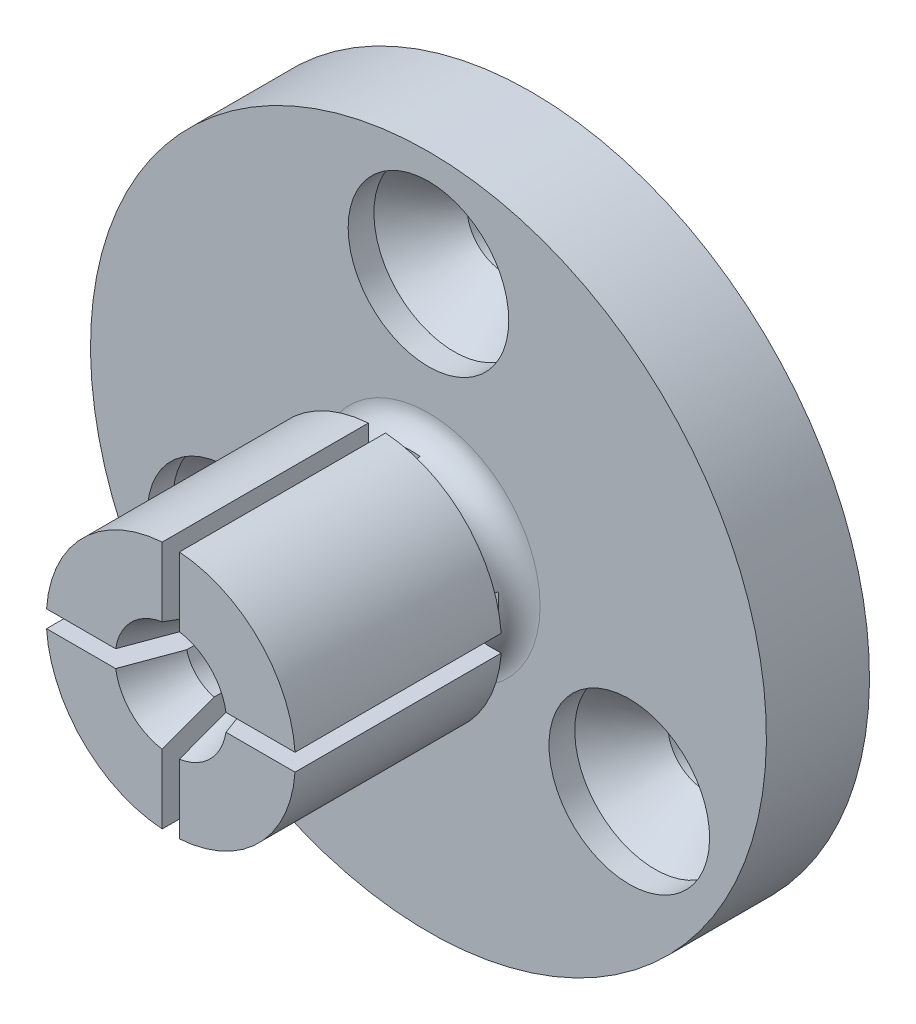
ISO-10303-21;
HEADER;
FILE_DESCRIPTION(('STEP AP214'),'2;1');
FILE_NAME('part.step','',(''),(''),'','','');
FILE_SCHEMA(('AUTOMOTIVE_DESIGN { 1 0 10303 214 1 1 1 1 }'));
ENDSEC;
DATA;
#1=APPLICATION_CONTEXT('core data for automotive mechanical design processes');
#2=APPLICATION_PROTOCOL_DEFINITION('international standard','automotive_design',2000,#1);
#3=PRODUCT_CONTEXT('',#1,'mechanical');
#4=PRODUCT('Part','Part','',(#3));
#5=PRODUCT_RELATED_PRODUCT_CATEGORY('part','',(#4));
#6=PRODUCT_DEFINITION_FORMATION('','',#4);
#7=PRODUCT_DEFINITION_CONTEXT('part definition',#1,'design');
#8=PRODUCT_DEFINITION('design','',#6,#7);
#9=PRODUCT_DEFINITION_SHAPE('','',#8);
#10=(LENGTH_UNIT() NAMED_UNIT(*) SI_UNIT(.MILLI.,.METRE.));
#11=(NAMED_UNIT(*) PLANE_ANGLE_UNIT() SI_UNIT($,.RADIAN.));
#12=(NAMED_UNIT(*) SI_UNIT($,.STERADIAN.) SOLID_ANGLE_UNIT());
#13=UNCERTAINTY_MEASURE_WITH_UNIT(LENGTH_MEASURE(1.E-05),#10,'distance_accuracy_value','');
#14=(GEOMETRIC_REPRESENTATION_CONTEXT(3) GLOBAL_UNCERTAINTY_ASSIGNED_CONTEXT((#13)) GLOBAL_UNIT_ASSIGNED_CONTEXT((#10,
#11,#12)) REPRESENTATION_CONTEXT('',''));
#15=CARTESIAN_POINT('',(0.,0.,0.));
#16=DIRECTION('',(0.,0.,1.));
#17=DIRECTION('',(1.,0.,0.));
#18=AXIS2_PLACEMENT_3D('',#15,#16,#17);
#19=CARTESIAN_POINT('',(3.302,0.,4.572));
#20=DIRECTION('',(0.,0.,-1.));
#21=DIRECTION('',(0.,1.,0.));
#22=AXIS2_PLACEMENT_3D('',#19,#20,#21);
#23=PLANE('',#22);
#24=DIRECTION('',(0.,-1.,0.));
#25=VECTOR('',#24,1.);
#26=CARTESIAN_POINT('',(0.254,0.,4.572));
#27=LINE('',#26,#25);
#28=CARTESIAN_POINT('',(0.254000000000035,-3.29221627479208,4.57200000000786));
#29=VERTEX_POINT('',#28);
#30=CARTESIAN_POINT('',(0.25400000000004,-3.67423093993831,4.572));
#31=VERTEX_POINT('',#30);
#32=EDGE_CURVE('E236',#29,#31,#27,.T.);
#33=ORIENTED_EDGE('',*,*,#32,.F.);
#34=CARTESIAN_POINT('',(0.,0.,4.572));
#35=DIRECTION('',(0.,0.,-1.));
#36=DIRECTION('',(0.,1.,0.));
#37=AXIS2_PLACEMENT_3D('',#34,#35,#36);
#38=CIRCLE('',#37,3.302);
#39=CARTESIAN_POINT('',(3.29221627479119,-0.254,4.572));
#40=VERTEX_POINT('',#39);
#41=EDGE_CURVE('E489',#40,#29,#38,.T.);
#42=ORIENTED_EDGE('',*,*,#41,.F.);
#43=DIRECTION('',(-1.,0.,0.));
#44=VECTOR('',#43,1.);
#45=CARTESIAN_POINT('',(3.302,-0.254,4.572));
#46=LINE('',#45,#44);
#47=CARTESIAN_POINT('',(3.67423093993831,-0.254,4.572));
#48=VERTEX_POINT('',#47);
#49=EDGE_CURVE('E400',#48,#40,#46,.T.);
#50=ORIENTED_EDGE('',*,*,#49,.F.);
#51=CARTESIAN_POINT('',(0.,0.,4.572));
#52=DIRECTION('',(0.,0.,-1.));
#53=DIRECTION('',(0.,1.,0.));
#54=AXIS2_PLACEMENT_3D('',#51,#52,#53);
#55=CIRCLE('',#54,3.683);
#56=EDGE_CURVE('E497',#48,#31,#55,.T.);
#57=ORIENTED_EDGE('',*,*,#56,.T.);
#58=EDGE_LOOP('',(#33,#42,#50,#57));
#59=FACE_BOUND('',#58,.T.);
#60=ADVANCED_FACE('F14',(#59),#23,.T.);
#61=CARTESIAN_POINT('',(0.,0.,0.));
#62=DIRECTION('',(0.,0.,-1.));
#63=DIRECTION('',(0.,1.,0.));
#64=AXIS2_PLACEMENT_3D('',#61,#62,#63);
#65=CYLINDRICAL_SURFACE('',#64,3.683);
#66=DIRECTION('',(0.,0.,-1.));
#67=VECTOR('',#66,1.);
#68=CARTESIAN_POINT('',(0.25400000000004,-3.67423093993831,0.));
#69=LINE('',#68,#67);
#70=CARTESIAN_POINT('',(0.25400000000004,-3.67423093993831,10.668));
#71=VERTEX_POINT('',#70);
#72=EDGE_CURVE('E611',#31,#71,#69,.F.);
#73=ORIENTED_EDGE('',*,*,#72,.F.);
#74=ORIENTED_EDGE('',*,*,#56,.F.);
#75=DIRECTION('',(0.,0.,-1.));
#76=VECTOR('',#75,1.);
#77=CARTESIAN_POINT('',(3.67423093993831,-0.254,0.));
#78=LINE('',#77,#76);
#79=CARTESIAN_POINT('',(3.67423093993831,-0.254,10.668));
#80=VERTEX_POINT('',#79);
#81=EDGE_CURVE('E398',#80,#48,#78,.T.);
#82=ORIENTED_EDGE('',*,*,#81,.F.);
#83=CARTESIAN_POINT('',(0.,0.,10.668));
#84=DIRECTION('',(0.,0.,-1.));
#85=DIRECTION('',(0.,1.,0.));
#86=AXIS2_PLACEMENT_3D('',#83,#84,#85);
#87=CIRCLE('',#86,3.683);
#88=EDGE_CURVE('E568',#80,#71,#87,.T.);
#89=ORIENTED_EDGE('',*,*,#88,.T.);
#90=EDGE_LOOP('',(#73,#74,#82,#89));
#91=FACE_BOUND('',#90,.T.);
#92=ADVANCED_FACE('F618',(#91),#65,.T.);
#93=CARTESIAN_POINT('',(3.683,0.,10.668));
#94=DIRECTION('',(0.,0.,1.));
#95=DIRECTION('',(0.,-1.,0.));
#96=AXIS2_PLACEMENT_3D('',#93,#94,#95);
#97=PLANE('',#96);
#98=DIRECTION('',(0.,1.,0.));
#99=VECTOR('',#98,1.);
#100=CARTESIAN_POINT('',(0.254000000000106,-9.99167203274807,10.668));
#101=LINE('',#100,#99);
#102=CARTESIAN_POINT('',(0.254000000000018,-1.63134453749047,10.668));
#103=VERTEX_POINT('',#102);
#104=EDGE_CURVE('E213',#71,#103,#101,.T.);
#105=ORIENTED_EDGE('',*,*,#104,.F.);
#106=ORIENTED_EDGE('',*,*,#88,.F.);
#107=DIRECTION('',(1.,0.,0.));
#108=VECTOR('',#107,1.);
#109=CARTESIAN_POINT('',(9.99167203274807,-0.254,10.668));
#110=LINE('',#109,#108);
#111=CARTESIAN_POINT('',(1.63134453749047,-0.254,10.668));
#112=VERTEX_POINT('',#111);
#113=EDGE_CURVE('E376',#112,#80,#110,.T.);
#114=ORIENTED_EDGE('',*,*,#113,.F.);
#115=CARTESIAN_POINT('',(0.,0.,10.668));
#116=DIRECTION('',(0.,0.,-1.));
#117=DIRECTION('',(0.,1.,0.));
#118=AXIS2_PLACEMENT_3D('',#115,#116,#117);
#119=CIRCLE('',#118,1.651);
#120=EDGE_CURVE('E430',#112,#103,#119,.T.);
#121=ORIENTED_EDGE('',*,*,#120,.T.);
#122=EDGE_LOOP('',(#105,#106,#114,#121));
#123=FACE_BOUND('',#122,.T.);
#124=ADVANCED_FACE('F620',(#123),#97,.T.);
#125=CARTESIAN_POINT('',(0.,0.,10.668));
#126=DIRECTION('',(0.,0.,1.));
#127=DIRECTION('',(0.,-1.,0.));
#128=AXIS2_PLACEMENT_3D('',#125,#126,#127);
#129=CONICAL_SURFACE('',#128,1.651,0.349065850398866);
#130=CARTESIAN_POINT('',(0.254000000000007,-0.528406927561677,7.74271906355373));
#131=CARTESIAN_POINT('',(0.254000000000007,-0.555658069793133,7.81024916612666));
#132=CARTESIAN_POINT('',(0.254000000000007,-0.58260434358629,7.87790088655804));
#133=CARTESIAN_POINT('',(0.254000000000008,-0.636038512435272,8.01338390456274));
#134=CARTESIAN_POINT('',(0.254000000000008,-0.66252641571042,8.08121519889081));
#135=CARTESIAN_POINT('',(0.254000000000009,-0.715195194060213,8.21699362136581));
#136=CARTESIAN_POINT('',(0.254000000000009,-0.741376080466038,8.2849407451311));
#137=CARTESIAN_POINT('',(0.25400000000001,-0.79350996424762,8.42092273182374));
#138=CARTESIAN_POINT('',(0.25400000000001,-0.819462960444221,8.48895759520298));
#139=CARTESIAN_POINT('',(0.25400000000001,-0.898465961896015,8.69683035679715));
#140=CARTESIAN_POINT('',(0.254000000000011,-0.951245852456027,8.83677084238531));
#141=CARTESIAN_POINT('',(0.254000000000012,-1.05638141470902,9.11681264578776));
#142=CARTESIAN_POINT('',(0.254000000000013,-1.10873708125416,9.25691396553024));
#143=CARTESIAN_POINT('',(0.254000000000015,-1.26401903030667,9.67367274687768));
#144=CARTESIAN_POINT('',(0.254000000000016,-1.36655196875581,9.95047668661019));
#145=CARTESIAN_POINT('',(0.254000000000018,-1.5710995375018,10.5042739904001));
#146=CARTESIAN_POINT('',(0.254000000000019,-1.67311417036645,10.7812673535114));
#147=CARTESIAN_POINT('',(0.254000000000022,-1.96362155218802,11.5713581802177));
#148=CARTESIAN_POINT('',(0.254000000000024,-2.15175621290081,12.0845872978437));
#149=CARTESIAN_POINT('',(0.254000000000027,-2.43363794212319,12.8545489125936));
#150=CARTESIAN_POINT('',(0.254000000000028,-2.52754529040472,13.1112228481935));
#151=CARTESIAN_POINT('',(0.25400000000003,-2.71527626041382,13.6246012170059));
#152=CARTESIAN_POINT('',(0.254000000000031,-2.8090998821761,13.8813056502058));
#153=CARTESIAN_POINT('',(0.254000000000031,-2.90289324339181,14.1380211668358));
#154=B_SPLINE_CURVE_WITH_KNOTS('',3,(#130,#131,#132,#133,#134,#135,#136,#137,#138,#139,#140,
#141,#142,#143,#144,#145,#146,#147,#148,#149,#150,#151,#152,#153),.UNSPECIFIED.,.F.,.F.,(4,2,2,
2,2,2,2,2,2,2,2,4),(0.,0.218461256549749,0.4369185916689,0.6553678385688,0.873818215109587,
1.32250550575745,1.77119823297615,2.65674796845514,3.54229331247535,5.1821672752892,
6.00210686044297,6.82204610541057),.UNSPECIFIED.);
#155=CARTESIAN_POINT('',(0.254000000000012,-1.06225460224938,9.13270961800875));
#156=VERTEX_POINT('',#155);
#157=EDGE_CURVE('E476',#103,#156,#154,.F.);
#158=ORIENTED_EDGE('',*,*,#157,.F.);
#159=ORIENTED_EDGE('',*,*,#120,.F.);
#160=CARTESIAN_POINT('',(0.528407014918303,-0.254,7.74271927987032));
#161=CARTESIAN_POINT('',(0.555658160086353,-0.254,7.81024939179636));
#162=CARTESIAN_POINT('',(0.582604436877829,-0.254,7.87790112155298));
#163=CARTESIAN_POINT('',(0.636038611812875,-0.254,8.01338415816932));
#164=CARTESIAN_POINT('',(0.66252651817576,-0.254,8.0812154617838));
#165=CARTESIAN_POINT('',(0.715195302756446,-0.254,8.21699390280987));
#166=CARTESIAN_POINT('',(0.741376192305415,-0.254,8.28494103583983));
#167=CARTESIAN_POINT('',(0.79351008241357,-0.254,8.42092304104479));
#168=CARTESIAN_POINT('',(0.819463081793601,-0.254,8.48895791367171));
#169=CARTESIAN_POINT('',(0.898466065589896,-0.254,8.69683063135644));
#170=CARTESIAN_POINT('',(0.951245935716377,-0.254,8.83677106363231));
#171=CARTESIAN_POINT('',(1.05638145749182,-0.254,9.11681276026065));
#172=CARTESIAN_POINT('',(1.10873710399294,-0.254,9.25691402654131));
#173=CARTESIAN_POINT('',(1.26401901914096,-0.254,9.67367271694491));
#174=CARTESIAN_POINT('',(1.36655194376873,-0.254,9.95047661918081));
#175=CARTESIAN_POINT('',(1.57109948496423,-0.254,10.5042738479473));
#176=CARTESIAN_POINT('',(1.67311410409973,-0.254,10.7812671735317));
#177=CARTESIAN_POINT('',(1.96362147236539,-0.254,11.5713579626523));
#178=CARTESIAN_POINT('',(2.15175613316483,-0.254,12.0845870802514));
#179=CARTESIAN_POINT('',(2.43363786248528,-0.254,12.8545486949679));
#180=CARTESIAN_POINT('',(2.52754521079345,-0.254,13.1112226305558));
#181=CARTESIAN_POINT('',(2.71527618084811,-0.254,13.624600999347));
#182=CARTESIAN_POINT('',(2.80909980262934,-0.254,13.8813054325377));
#183=CARTESIAN_POINT('',(2.90289316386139,-0.254,14.1380209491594));
#184=B_SPLINE_CURVE_WITH_KNOTS('',3,(#160,#161,#162,#163,#164,#165,#166,#167,#168,#169,#170,
#171,#172,#173,#174,#175,#176,#177,#178,#179,#180,#181,#182,#183),.UNSPECIFIED.,.F.,.F.,(4,2,2,
2,2,2,2,2,2,2,2,4),(0.,0.218461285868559,0.436918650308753,0.655367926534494,0.873818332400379,
1.32250545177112,1.77119800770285,2.65674762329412,3.54229284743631,5.18216681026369,
6.0021063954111,6.82204564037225),.UNSPECIFIED.);
#185=CARTESIAN_POINT('',(1.06225460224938,-0.254,9.13270961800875));
#186=VERTEX_POINT('',#185);
#187=EDGE_CURVE('E510',#186,#112,#184,.T.);
#188=ORIENTED_EDGE('',*,*,#187,.F.);
#189=CARTESIAN_POINT('',(0.,0.,9.13270961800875));
#190=DIRECTION('',(0.,0.,-1.));
#191=DIRECTION('',(0.,1.,0.));
#192=AXIS2_PLACEMENT_3D('',#189,#190,#191);
#193=CIRCLE('',#192,1.0922);
#194=EDGE_CURVE('E416',#186,#156,#193,.T.);
#195=ORIENTED_EDGE('',*,*,#194,.T.);
#196=EDGE_LOOP('',(#158,#159,#188,#195));
#197=FACE_BOUND('',#196,.T.);
#198=ADVANCED_FACE('F609',(#197),#129,.F.);
#199=DIRECTION('',(0.,1.,0.));
#200=VECTOR('',#199,1.);
#201=CARTESIAN_POINT('',(-0.254,0.,4.572));
#202=LINE('',#201,#200);
#203=CARTESIAN_POINT('',(-0.25399999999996,-3.67423093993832,4.572));
#204=VERTEX_POINT('',#203);
#205=CARTESIAN_POINT('',(-0.253999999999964,-3.29221627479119,4.572));
#206=VERTEX_POINT('',#205);
#207=EDGE_CURVE('E221',#204,#206,#202,.T.);
#208=ORIENTED_EDGE('',*,*,#207,.F.);
#209=CARTESIAN_POINT('',(-3.67423093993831,-0.254000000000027,4.572));
#210=VERTEX_POINT('',#209);
#211=EDGE_CURVE('E566',#204,#210,#55,.T.);
#212=ORIENTED_EDGE('',*,*,#211,.T.);
#213=DIRECTION('',(-1.,0.,0.));
#214=VECTOR('',#213,1.);
#215=CARTESIAN_POINT('',(3.302,-0.253999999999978,4.572));
#216=LINE('',#215,#214);
#217=CARTESIAN_POINT('',(-3.29221627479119,-0.254000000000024,4.572));
#218=VERTEX_POINT('',#217);
#219=EDGE_CURVE('E461',#218,#210,#216,.T.);
#220=ORIENTED_EDGE('',*,*,#219,.F.);
#221=EDGE_CURVE('E486',#206,#218,#38,.T.);
#222=ORIENTED_EDGE('',*,*,#221,.F.);
#223=EDGE_LOOP('',(#208,#212,#220,#222));
#224=FACE_BOUND('',#223,.T.);
#225=ADVANCED_FACE('F665',(#224),#23,.T.);
#226=DIRECTION('',(0.,0.,-1.));
#227=VECTOR('',#226,1.);
#228=CARTESIAN_POINT('',(-0.25399999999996,-3.67423093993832,0.));
#229=LINE('',#228,#227);
#230=CARTESIAN_POINT('',(-0.25399999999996,-3.67423093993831,10.668));
#231=VERTEX_POINT('',#230);
#232=EDGE_CURVE('E226',#231,#204,#229,.T.);
#233=ORIENTED_EDGE('',*,*,#232,.F.);
#234=CARTESIAN_POINT('',(-3.67423093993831,-0.254000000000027,10.668));
#235=VERTEX_POINT('',#234);
#236=EDGE_CURVE('E471',#231,#235,#87,.T.);
#237=ORIENTED_EDGE('',*,*,#236,.T.);
#238=DIRECTION('',(0.,0.,-1.));
#239=VECTOR('',#238,1.);
#240=CARTESIAN_POINT('',(-3.67423093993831,-0.254000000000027,0.));
#241=LINE('',#240,#239);
#242=EDGE_CURVE('E343',#210,#235,#241,.F.);
#243=ORIENTED_EDGE('',*,*,#242,.F.);
#244=ORIENTED_EDGE('',*,*,#211,.F.);
#245=EDGE_LOOP('',(#233,#237,#243,#244));
#246=FACE_BOUND('',#245,.T.);
#247=ADVANCED_FACE('F670',(#246),#65,.T.);
#248=DIRECTION('',(0.,-1.,0.));
#249=VECTOR('',#248,1.);
#250=CARTESIAN_POINT('',(-0.253999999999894,-9.99167203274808,10.668));
#251=LINE('',#250,#249);
#252=CARTESIAN_POINT('',(-0.253999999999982,-1.63134453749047,10.668));
#253=VERTEX_POINT('',#252);
#254=EDGE_CURVE('E621',#253,#231,#251,.T.);
#255=ORIENTED_EDGE('',*,*,#254,.F.);
#256=CARTESIAN_POINT('',(-1.63134453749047,-0.254000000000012,10.668));
#257=VERTEX_POINT('',#256);
#258=EDGE_CURVE('E472',#253,#257,#119,.T.);
#259=ORIENTED_EDGE('',*,*,#258,.T.);
#260=DIRECTION('',(1.,0.,0.));
#261=VECTOR('',#260,1.);
#262=CARTESIAN_POINT('',(-9.99167203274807,-0.254000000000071,10.668));
#263=LINE('',#262,#261);
#264=EDGE_CURVE('E442',#235,#257,#263,.T.);
#265=ORIENTED_EDGE('',*,*,#264,.F.);
#266=ORIENTED_EDGE('',*,*,#236,.F.);
#267=EDGE_LOOP('',(#255,#259,#265,#266));
#268=FACE_BOUND('',#267,.T.);
#269=ADVANCED_FACE('F470',(#268),#97,.T.);
#270=CARTESIAN_POINT('',(-0.253999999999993,-0.528407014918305,7.74271927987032));
#271=CARTESIAN_POINT('',(-0.253999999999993,-0.555658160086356,7.81024939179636));
#272=CARTESIAN_POINT('',(-0.253999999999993,-0.582604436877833,7.87790112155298));
#273=CARTESIAN_POINT('',(-0.253999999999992,-0.636038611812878,8.01338415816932));
#274=CARTESIAN_POINT('',(-0.253999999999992,-0.662526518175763,8.0812154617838));
#275=CARTESIAN_POINT('',(-0.253999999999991,-0.715195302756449,8.21699390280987));
#276=CARTESIAN_POINT('',(-0.253999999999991,-0.741376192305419,8.28494103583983));
#277=CARTESIAN_POINT('',(-0.25399999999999,-0.793510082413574,8.4209230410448));
#278=CARTESIAN_POINT('',(-0.25399999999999,-0.819463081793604,8.48895791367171));
#279=CARTESIAN_POINT('',(-0.25399999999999,-0.898466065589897,8.69683063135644));
#280=CARTESIAN_POINT('',(-0.253999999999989,-0.95124593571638,8.83677106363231));
#281=CARTESIAN_POINT('',(-0.253999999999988,-1.05638145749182,9.11681276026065));
#282=CARTESIAN_POINT('',(-0.253999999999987,-1.10873710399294,9.25691402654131));
#283=CARTESIAN_POINT('',(-0.253999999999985,-1.26401901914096,9.67367271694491));
#284=CARTESIAN_POINT('',(-0.253999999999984,-1.36655194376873,9.95047661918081));
#285=CARTESIAN_POINT('',(-0.253999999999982,-1.57109948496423,10.5042738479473));
#286=CARTESIAN_POINT('',(-0.253999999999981,-1.67311410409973,10.7812671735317));
#287=CARTESIAN_POINT('',(-0.253999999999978,-1.96362147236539,11.5713579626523));
#288=CARTESIAN_POINT('',(-0.253999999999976,-2.15175613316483,12.0845870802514));
#289=CARTESIAN_POINT('',(-0.253999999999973,-2.43363786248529,12.8545486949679));
#290=CARTESIAN_POINT('',(-0.253999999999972,-2.52754521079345,13.1112226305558));
#291=CARTESIAN_POINT('',(-0.25399999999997,-2.71527618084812,13.624600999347));
#292=CARTESIAN_POINT('',(-0.253999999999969,-2.80909980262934,13.8813054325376));
#293=CARTESIAN_POINT('',(-0.253999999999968,-2.90289316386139,14.1380209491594));
#294=B_SPLINE_CURVE_WITH_KNOTS('',3,(#270,#271,#272,#273,#274,#275,#276,#277,#278,#279,#280,
#281,#282,#283,#284,#285,#286,#287,#288,#289,#290,#291,#292,#293),.UNSPECIFIED.,.F.,.F.,(4,2,2,
2,2,2,2,2,2,2,2,4),(0.,0.21846128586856,0.436918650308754,0.655367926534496,0.873818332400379,
1.32250545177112,1.77119800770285,2.65674762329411,3.54229284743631,5.1821668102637,
6.0021063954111,6.82204564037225),.UNSPECIFIED.);
#295=CARTESIAN_POINT('',(-0.253999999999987,-1.06225460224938,9.13270961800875));
#296=VERTEX_POINT('',#295);
#297=EDGE_CURVE('E228',#296,#253,#294,.T.);
#298=ORIENTED_EDGE('',*,*,#297,.F.);
#299=CARTESIAN_POINT('',(-1.06225460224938,-0.254000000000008,9.13270961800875));
#300=VERTEX_POINT('',#299);
#301=EDGE_CURVE('E218',#296,#300,#193,.T.);
#302=ORIENTED_EDGE('',*,*,#301,.T.);
#303=CARTESIAN_POINT('',(-0.5284070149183,-0.254000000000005,7.74271927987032));
#304=CARTESIAN_POINT('',(-0.55565816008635,-0.254000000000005,7.81024939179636));
#305=CARTESIAN_POINT('',(-0.582604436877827,-0.254000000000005,7.87790112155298));
#306=CARTESIAN_POINT('',(-0.636038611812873,-0.254000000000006,8.01338415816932));
#307=CARTESIAN_POINT('',(-0.662526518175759,-0.254000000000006,8.0812154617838));
#308=CARTESIAN_POINT('',(-0.715195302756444,-0.254000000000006,8.21699390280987));
#309=CARTESIAN_POINT('',(-0.741376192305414,-0.254000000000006,8.28494103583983));
#310=CARTESIAN_POINT('',(-0.793510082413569,-0.254000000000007,8.4209230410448));
#311=CARTESIAN_POINT('',(-0.819463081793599,-0.254000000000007,8.48895791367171));
#312=CARTESIAN_POINT('',(-0.898466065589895,-0.254000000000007,8.69683063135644));
#313=CARTESIAN_POINT('',(-0.951245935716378,-0.254000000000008,8.83677106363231));
#314=CARTESIAN_POINT('',(-1.05638145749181,-0.254000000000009,9.11681276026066));
#315=CARTESIAN_POINT('',(-1.10873710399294,-0.254000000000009,9.25691402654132));
#316=CARTESIAN_POINT('',(-1.26401901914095,-0.25400000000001,9.67367271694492));
#317=CARTESIAN_POINT('',(-1.36655194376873,-0.254000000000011,9.95047661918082));
#318=CARTESIAN_POINT('',(-1.57109948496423,-0.254000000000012,10.5042738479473));
#319=CARTESIAN_POINT('',(-1.67311410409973,-0.254000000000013,10.7812671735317));
#320=CARTESIAN_POINT('',(-1.96362147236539,-0.254000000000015,11.5713579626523));
#321=CARTESIAN_POINT('',(-2.15175613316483,-0.254000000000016,12.0845870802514));
#322=CARTESIAN_POINT('',(-2.43363786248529,-0.254000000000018,12.8545486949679));
#323=CARTESIAN_POINT('',(-2.52754521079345,-0.254000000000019,13.1112226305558));
#324=CARTESIAN_POINT('',(-2.71527618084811,-0.25400000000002,13.624600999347));
#325=CARTESIAN_POINT('',(-2.80909980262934,-0.254000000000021,13.8813054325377));
#326=CARTESIAN_POINT('',(-2.90289316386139,-0.254000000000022,14.1380209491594));
#327=B_SPLINE_CURVE_WITH_KNOTS('',3,(#303,#304,#305,#306,#307,#308,#309,#310,#311,#312,#313,
#314,#315,#316,#317,#318,#319,#320,#321,#322,#323,#324,#325,#326),.UNSPECIFIED.,.F.,.F.,(4,2,2,
2,2,2,2,2,2,2,2,4),(0.,0.21846128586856,0.436918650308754,0.655367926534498,0.873818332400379,
1.32250545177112,1.77119800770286,2.65674762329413,3.54229284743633,5.18216681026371,
6.00210639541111,6.82204564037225),.UNSPECIFIED.);
#328=EDGE_CURVE('E334',#257,#300,#327,.F.);
#329=ORIENTED_EDGE('',*,*,#328,.F.);
#330=ORIENTED_EDGE('',*,*,#258,.F.);
#331=EDGE_LOOP('',(#298,#302,#329,#330));
#332=FACE_BOUND('',#331,.T.);
#333=ADVANCED_FACE('F433',(#332),#129,.F.);
#334=DIRECTION('',(1.,0.,0.));
#335=VECTOR('',#334,1.);
#336=CARTESIAN_POINT('',(3.302,0.254000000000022,4.572));
#337=LINE('',#336,#335);
#338=CARTESIAN_POINT('',(-3.67423093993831,0.253999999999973,4.572));
#339=VERTEX_POINT('',#338);
#340=CARTESIAN_POINT('',(-3.29221627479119,0.253999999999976,4.572));
#341=VERTEX_POINT('',#340);
#342=EDGE_CURVE('E445',#339,#341,#337,.T.);
#343=ORIENTED_EDGE('',*,*,#342,.F.);
#344=CARTESIAN_POINT('',(-0.254000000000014,3.67423093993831,4.572));
#345=VERTEX_POINT('',#344);
#346=EDGE_CURVE('E563',#339,#345,#55,.T.);
#347=ORIENTED_EDGE('',*,*,#346,.T.);
#348=DIRECTION('',(0.,1.,0.));
#349=VECTOR('',#348,1.);
#350=CARTESIAN_POINT('',(-0.254,0.,4.572));
#351=LINE('',#350,#349);
#352=CARTESIAN_POINT('',(-0.254000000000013,3.29221627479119,4.572));
#353=VERTEX_POINT('',#352);
#354=EDGE_CURVE('E369',#353,#345,#351,.T.);
#355=ORIENTED_EDGE('',*,*,#354,.F.);
#356=EDGE_CURVE('E490',#341,#353,#38,.T.);
#357=ORIENTED_EDGE('',*,*,#356,.F.);
#358=EDGE_LOOP('',(#343,#347,#355,#357));
#359=FACE_BOUND('',#358,.T.);
#360=ADVANCED_FACE('F561',(#359),#23,.T.);
#361=DIRECTION('',(0.,0.,-1.));
#362=VECTOR('',#361,1.);
#363=CARTESIAN_POINT('',(-3.67423093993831,0.253999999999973,0.));
#364=LINE('',#363,#362);
#365=CARTESIAN_POINT('',(-3.67423093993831,0.253999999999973,10.668));
#366=VERTEX_POINT('',#365);
#367=EDGE_CURVE('E448',#366,#339,#364,.T.);
#368=ORIENTED_EDGE('',*,*,#367,.F.);
#369=CARTESIAN_POINT('',(-0.254000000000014,3.67423093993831,10.668));
#370=VERTEX_POINT('',#369);
#371=EDGE_CURVE('E585',#366,#370,#87,.T.);
#372=ORIENTED_EDGE('',*,*,#371,.T.);
#373=DIRECTION('',(0.,0.,-1.));
#374=VECTOR('',#373,1.);
#375=CARTESIAN_POINT('',(-0.254000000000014,3.67423093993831,0.));
#376=LINE('',#375,#374);
#377=EDGE_CURVE('E367',#345,#370,#376,.F.);
#378=ORIENTED_EDGE('',*,*,#377,.F.);
#379=ORIENTED_EDGE('',*,*,#346,.F.);
#380=EDGE_LOOP('',(#368,#372,#378,#379));
#381=FACE_BOUND('',#380,.T.);
#382=ADVANCED_FACE('F678',(#381),#65,.T.);
#383=DIRECTION('',(-1.,0.,0.));
#384=VECTOR('',#383,1.);
#385=CARTESIAN_POINT('',(-9.99167203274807,0.253999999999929,10.668));
#386=LINE('',#385,#384);
#387=CARTESIAN_POINT('',(-1.63134453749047,0.253999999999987,10.668));
#388=VERTEX_POINT('',#387);
#389=EDGE_CURVE('E473',#388,#366,#386,.T.);
#390=ORIENTED_EDGE('',*,*,#389,.F.);
#391=CARTESIAN_POINT('',(-0.254000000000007,1.63134453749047,10.668));
#392=VERTEX_POINT('',#391);
#393=EDGE_CURVE('E429',#388,#392,#119,.T.);
#394=ORIENTED_EDGE('',*,*,#393,.T.);
#395=DIRECTION('',(0.,-1.,0.));
#396=VECTOR('',#395,1.);
#397=CARTESIAN_POINT('',(-0.254000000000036,9.99167203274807,10.668));
#398=LINE('',#397,#396);
#399=EDGE_CURVE('E346',#370,#392,#398,.T.);
#400=ORIENTED_EDGE('',*,*,#399,.F.);
#401=ORIENTED_EDGE('',*,*,#371,.F.);
#402=EDGE_LOOP('',(#390,#394,#400,#401));
#403=FACE_BOUND('',#402,.T.);
#404=ADVANCED_FACE('F593',(#403),#97,.T.);
#405=CARTESIAN_POINT('',(-0.528407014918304,0.253999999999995,7.74271927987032));
#406=CARTESIAN_POINT('',(-0.555658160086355,0.253999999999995,7.81024939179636));
#407=CARTESIAN_POINT('',(-0.582604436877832,0.253999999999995,7.87790112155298));
#408=CARTESIAN_POINT('',(-0.636038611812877,0.253999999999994,8.01338415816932));
#409=CARTESIAN_POINT('',(-0.662526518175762,0.253999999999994,8.0812154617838));
#410=CARTESIAN_POINT('',(-0.715195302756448,0.253999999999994,8.21699390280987));
#411=CARTESIAN_POINT('',(-0.741376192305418,0.253999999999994,8.28494103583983));
#412=CARTESIAN_POINT('',(-0.793510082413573,0.253999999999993,8.4209230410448));
#413=CARTESIAN_POINT('',(-0.819463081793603,0.253999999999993,8.48895791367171));
#414=CARTESIAN_POINT('',(-0.898466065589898,0.253999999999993,8.69683063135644));
#415=CARTESIAN_POINT('',(-0.95124593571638,0.253999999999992,8.83677106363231));
#416=CARTESIAN_POINT('',(-1.05638145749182,0.253999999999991,9.11681276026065));
#417=CARTESIAN_POINT('',(-1.10873710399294,0.253999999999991,9.25691402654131));
#418=CARTESIAN_POINT('',(-1.26401901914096,0.25399999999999,9.67367271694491));
#419=CARTESIAN_POINT('',(-1.36655194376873,0.253999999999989,9.95047661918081));
#420=CARTESIAN_POINT('',(-1.57109948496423,0.253999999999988,10.5042738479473));
#421=CARTESIAN_POINT('',(-1.67311410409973,0.253999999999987,10.7812671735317));
#422=CARTESIAN_POINT('',(-1.96362147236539,0.253999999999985,11.5713579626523));
#423=CARTESIAN_POINT('',(-2.15175613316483,0.253999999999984,12.0845870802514));
#424=CARTESIAN_POINT('',(-2.43363786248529,0.253999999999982,12.8545486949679));
#425=CARTESIAN_POINT('',(-2.52754521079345,0.253999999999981,13.1112226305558));
#426=CARTESIAN_POINT('',(-2.71527618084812,0.25399999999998,13.624600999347));
#427=CARTESIAN_POINT('',(-2.80909980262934,0.253999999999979,13.8813054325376));
#428=CARTESIAN_POINT('',(-2.90289316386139,0.253999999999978,14.1380209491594));
#429=B_SPLINE_CURVE_WITH_KNOTS('',3,(#405,#406,#407,#408,#409,#410,#411,#412,#413,#414,#415,
#416,#417,#418,#419,#420,#421,#422,#423,#424,#425,#426,#427,#428),.UNSPECIFIED.,.F.,.F.,(4,2,2,
2,2,2,2,2,2,2,2,4),(0.,0.21846128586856,0.436918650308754,0.655367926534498,0.873818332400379,
1.32250545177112,1.77119800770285,2.65674762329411,3.54229284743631,5.18216681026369,
6.0021063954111,6.82204564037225),.UNSPECIFIED.);
#430=CARTESIAN_POINT('',(-1.06225460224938,0.253999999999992,9.13270961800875));
#431=VERTEX_POINT('',#430);
#432=EDGE_CURVE('E456',#431,#388,#429,.T.);
#433=ORIENTED_EDGE('',*,*,#432,.F.);
#434=CARTESIAN_POINT('',(-0.254000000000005,1.06225460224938,9.13270961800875));
#435=VERTEX_POINT('',#434);
#436=EDGE_CURVE('E415',#431,#435,#193,.T.);
#437=ORIENTED_EDGE('',*,*,#436,.T.);
#438=CARTESIAN_POINT('',(-0.254,0.528407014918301,7.74271927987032));
#439=CARTESIAN_POINT('',(-0.254000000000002,0.555658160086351,7.81024939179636));
#440=CARTESIAN_POINT('',(-0.254000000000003,0.582604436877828,7.87790112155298));
#441=CARTESIAN_POINT('',(-0.254000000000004,0.636038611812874,8.01338415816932));
#442=CARTESIAN_POINT('',(-0.254000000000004,0.662526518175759,8.0812154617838));
#443=CARTESIAN_POINT('',(-0.254000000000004,0.715195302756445,8.21699390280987));
#444=CARTESIAN_POINT('',(-0.254000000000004,0.741376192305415,8.28494103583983));
#445=CARTESIAN_POINT('',(-0.254000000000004,0.79351008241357,8.4209230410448));
#446=CARTESIAN_POINT('',(-0.254000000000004,0.8194630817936,8.48895791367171));
#447=CARTESIAN_POINT('',(-0.254000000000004,0.898466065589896,8.69683063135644));
#448=CARTESIAN_POINT('',(-0.254000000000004,0.951245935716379,8.83677106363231));
#449=CARTESIAN_POINT('',(-0.254000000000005,1.05638145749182,9.11681276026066));
#450=CARTESIAN_POINT('',(-0.254000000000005,1.10873710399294,9.25691402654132));
#451=CARTESIAN_POINT('',(-0.254000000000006,1.26401901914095,9.67367271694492));
#452=CARTESIAN_POINT('',(-0.254000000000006,1.36655194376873,9.95047661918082));
#453=CARTESIAN_POINT('',(-0.254000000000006,1.57109948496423,10.5042738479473));
#454=CARTESIAN_POINT('',(-0.254000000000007,1.67311410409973,10.7812671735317));
#455=CARTESIAN_POINT('',(-0.254000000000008,1.96362147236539,11.5713579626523));
#456=CARTESIAN_POINT('',(-0.254000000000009,2.15175613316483,12.0845870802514));
#457=CARTESIAN_POINT('',(-0.25400000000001,2.43363786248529,12.8545486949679));
#458=CARTESIAN_POINT('',(-0.25400000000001,2.52754521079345,13.1112226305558));
#459=CARTESIAN_POINT('',(-0.254000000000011,2.71527618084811,13.624600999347));
#460=CARTESIAN_POINT('',(-0.254000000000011,2.80909980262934,13.8813054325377));
#461=CARTESIAN_POINT('',(-0.254000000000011,2.90289316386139,14.1380209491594));
#462=B_SPLINE_CURVE_WITH_KNOTS('',3,(#438,#439,#440,#441,#442,#443,#444,#445,#446,#447,#448,
#449,#450,#451,#452,#453,#454,#455,#456,#457,#458,#459,#460,#461),.UNSPECIFIED.,.F.,.F.,(4,2,2,
2,2,2,2,2,2,2,2,4),(0.,0.21846128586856,0.436918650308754,0.655367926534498,0.873818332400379,
1.32250545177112,1.77119800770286,2.65674762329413,3.54229284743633,5.18216681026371,
6.00210639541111,6.82204564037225),.UNSPECIFIED.);
#463=EDGE_CURVE('E547',#392,#435,#462,.F.);
#464=ORIENTED_EDGE('',*,*,#463,.F.);
#465=ORIENTED_EDGE('',*,*,#393,.F.);
#466=EDGE_LOOP('',(#433,#437,#464,#465));
#467=FACE_BOUND('',#466,.T.);
#468=ADVANCED_FACE('F599',(#467),#129,.F.);
#469=CARTESIAN_POINT('',(0.,0.,0.));
#470=DIRECTION('',(0.,0.,-1.));
#471=DIRECTION('',(0.,1.,0.));
#472=AXIS2_PLACEMENT_3D('',#469,#470,#471);
#473=CYLINDRICAL_SURFACE('',#472,1.0922);
#474=DIRECTION('',(0.,0.,1.));
#475=VECTOR('',#474,1.);
#476=CARTESIAN_POINT('',(0.254000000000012,-1.06225460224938,3.556));
#477=LINE('',#476,#475);
#478=CARTESIAN_POINT('',(0.254000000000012,-1.06225460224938,3.556));
#479=VERTEX_POINT('',#478);
#480=EDGE_CURVE('E219',#479,#156,#477,.T.);
#481=ORIENTED_EDGE('',*,*,#480,.T.);
#482=ORIENTED_EDGE('',*,*,#194,.F.);
#483=DIRECTION('',(0.,0.,1.));
#484=VECTOR('',#483,1.);
#485=CARTESIAN_POINT('',(1.06225460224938,-0.254,3.556));
#486=LINE('',#485,#484);
#487=CARTESIAN_POINT('',(1.06225460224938,-0.254,3.556));
#488=VERTEX_POINT('',#487);
#489=EDGE_CURVE('E394',#488,#186,#486,.T.);
#490=ORIENTED_EDGE('',*,*,#489,.F.);
#491=CARTESIAN_POINT('',(0.,0.,3.556));
#492=DIRECTION('',(0.,0.,-1.));
#493=DIRECTION('',(0.,-1.,0.));
#494=AXIS2_PLACEMENT_3D('',#491,#492,#493);
#495=CIRCLE('',#494,1.0922);
#496=CARTESIAN_POINT('',(1.06225460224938,0.254,3.556));
#497=VERTEX_POINT('',#496);
#498=EDGE_CURVE('E384',#497,#488,#495,.T.);
#499=ORIENTED_EDGE('',*,*,#498,.F.);
#500=DIRECTION('',(0.,0.,1.));
#501=VECTOR('',#500,1.);
#502=CARTESIAN_POINT('',(1.06225460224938,0.254,3.556));
#503=LINE('',#502,#501);
#504=CARTESIAN_POINT('',(1.06225460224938,0.254,9.13270961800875));
#505=VERTEX_POINT('',#504);
#506=EDGE_CURVE('E395',#497,#505,#503,.T.);
#507=ORIENTED_EDGE('',*,*,#506,.T.);
#508=CARTESIAN_POINT('',(0.253999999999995,1.06225460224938,9.13270961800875));
#509=VERTEX_POINT('',#508);
#510=EDGE_CURVE('E412',#509,#505,#193,.T.);
#511=ORIENTED_EDGE('',*,*,#510,.F.);
#512=DIRECTION('',(0.,0.,1.));
#513=VECTOR('',#512,1.);
#514=CARTESIAN_POINT('',(0.253999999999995,1.06225460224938,3.556));
#515=LINE('',#514,#513);
#516=CARTESIAN_POINT('',(0.253999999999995,1.06225460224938,3.556));
#517=VERTEX_POINT('',#516);
#518=EDGE_CURVE('E357',#517,#509,#515,.T.);
#519=ORIENTED_EDGE('',*,*,#518,.F.);
#520=CARTESIAN_POINT('',(0.,0.,3.556));
#521=DIRECTION('',(0.,0.,-1.));
#522=DIRECTION('',(1.,0.,0.));
#523=AXIS2_PLACEMENT_3D('',#520,#521,#522);
#524=CIRCLE('',#523,1.0922);
#525=CARTESIAN_POINT('',(-0.254000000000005,1.06225460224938,3.556));
#526=VERTEX_POINT('',#525);
#527=EDGE_CURVE('E349',#526,#517,#524,.T.);
#528=ORIENTED_EDGE('',*,*,#527,.F.);
#529=DIRECTION('',(0.,0.,1.));
#530=VECTOR('',#529,1.);
#531=CARTESIAN_POINT('',(-0.254000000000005,1.06225460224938,3.556));
#532=LINE('',#531,#530);
#533=EDGE_CURVE('E358',#526,#435,#532,.T.);
#534=ORIENTED_EDGE('',*,*,#533,.T.);
#535=ORIENTED_EDGE('',*,*,#436,.F.);
#536=DIRECTION('',(0.,0.,1.));
#537=VECTOR('',#536,1.);
#538=CARTESIAN_POINT('',(-1.06225460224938,0.253999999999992,3.556));
#539=LINE('',#538,#537);
#540=CARTESIAN_POINT('',(-1.06225460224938,0.253999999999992,3.556));
#541=VERTEX_POINT('',#540);
#542=EDGE_CURVE('E446',#541,#431,#539,.T.);
#543=ORIENTED_EDGE('',*,*,#542,.F.);
#544=CARTESIAN_POINT('',(0.,0.,3.556));
#545=DIRECTION('',(0.,0.,-1.));
#546=DIRECTION('',(0.,1.,0.));
#547=AXIS2_PLACEMENT_3D('',#544,#545,#546);
#548=CIRCLE('',#547,1.0922);
#549=CARTESIAN_POINT('',(-1.06225460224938,-0.254000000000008,3.556));
#550=VERTEX_POINT('',#549);
#551=EDGE_CURVE('E444',#550,#541,#548,.T.);
#552=ORIENTED_EDGE('',*,*,#551,.F.);
#553=DIRECTION('',(0.,0.,1.));
#554=VECTOR('',#553,1.);
#555=CARTESIAN_POINT('',(-1.06225460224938,-0.254000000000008,3.556));
#556=LINE('',#555,#554);
#557=EDGE_CURVE('E438',#550,#300,#556,.T.);
#558=ORIENTED_EDGE('',*,*,#557,.T.);
#559=ORIENTED_EDGE('',*,*,#301,.F.);
#560=DIRECTION('',(0.,0.,1.));
#561=VECTOR('',#560,1.);
#562=CARTESIAN_POINT('',(-0.253999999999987,-1.06225460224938,3.556));
#563=LINE('',#562,#561);
#564=CARTESIAN_POINT('',(-0.253999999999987,-1.06225460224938,3.556));
#565=VERTEX_POINT('',#564);
#566=EDGE_CURVE('E200',#565,#296,#563,.T.);
#567=ORIENTED_EDGE('',*,*,#566,.F.);
#568=CARTESIAN_POINT('',(0.,0.,3.556));
#569=DIRECTION('',(0.,0.,-1.));
#570=DIRECTION('',(-1.,0.,0.));
#571=AXIS2_PLACEMENT_3D('',#568,#569,#570);
#572=CIRCLE('',#571,1.0922);
#573=EDGE_CURVE('E205',#479,#565,#572,.T.);
#574=ORIENTED_EDGE('',*,*,#573,.F.);
#575=EDGE_LOOP('',(#481,#482,#490,#499,#507,#511,#519,#528,#534,#535,#543,#552,#558,#559,#567,#574));
#576=FACE_BOUND('',#575,.T.);
#577=CARTESIAN_POINT('',(0.,0.,0.));
#578=DIRECTION('',(0.,0.,-1.));
#579=DIRECTION('',(0.,1.,0.));
#580=AXIS2_PLACEMENT_3D('',#577,#578,#579);
#581=CIRCLE('',#580,1.0922);
#582=CARTESIAN_POINT('',(0.,1.0922,0.));
#583=VERTEX_POINT('',#582);
#584=EDGE_CURVE('E507',#583,#583,#581,.T.);
#585=ORIENTED_EDGE('',*,*,#584,.T.);
#586=EDGE_LOOP('',(#585));
#587=FACE_BOUND('',#586,.T.);
#588=ADVANCED_FACE('F16',(#576,#587),#473,.F.);
#589=CARTESIAN_POINT('',(1.0922,0.,0.));
#590=DIRECTION('',(0.,0.,-1.));
#591=DIRECTION('',(0.,1.,0.));
#592=AXIS2_PLACEMENT_3D('',#589,#590,#591);
#593=PLANE('',#592);
#594=CARTESIAN_POINT('',(5.93920221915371,-3.42899999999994,0.));
#595=DIRECTION('',(0.,0.,-1.));
#596=DIRECTION('',(0.,1.,0.));
#597=AXIS2_PLACEMENT_3D('',#594,#595,#596);
#598=CIRCLE('',#597,1.0922);
#599=CARTESIAN_POINT('',(5.93920221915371,-2.33679999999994,0.));
#600=VERTEX_POINT('',#599);
#601=EDGE_CURVE('E18',#600,#600,#598,.T.);
#602=ORIENTED_EDGE('',*,*,#601,.F.);
#603=EDGE_LOOP('',(#602));
#604=FACE_BOUND('',#603,.T.);
#605=CARTESIAN_POINT('',(-5.93920221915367,-3.429,0.));
#606=DIRECTION('',(0.,0.,-1.));
#607=DIRECTION('',(0.,1.,0.));
#608=AXIS2_PLACEMENT_3D('',#605,#606,#607);
#609=CIRCLE('',#608,1.0922);
#610=CARTESIAN_POINT('',(-5.93920221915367,-2.3368,0.));
#611=VERTEX_POINT('',#610);
#612=EDGE_CURVE('E633',#611,#611,#609,.T.);
#613=ORIENTED_EDGE('',*,*,#612,.F.);
#614=EDGE_LOOP('',(#613));
#615=FACE_BOUND('',#614,.T.);
#616=CARTESIAN_POINT('',(0.,6.858,0.));
#617=DIRECTION('',(0.,0.,-1.));
#618=DIRECTION('',(0.,1.,0.));
#619=AXIS2_PLACEMENT_3D('',#616,#617,#618);
#620=CIRCLE('',#619,1.0922);
#621=CARTESIAN_POINT('',(0.,7.9502,0.));
#622=VERTEX_POINT('',#621);
#623=EDGE_CURVE('E623',#622,#622,#620,.T.);
#624=ORIENTED_EDGE('',*,*,#623,.F.);
#625=EDGE_LOOP('',(#624));
#626=FACE_BOUND('',#625,.T.);
#627=CARTESIAN_POINT('',(0.,0.,0.));
#628=DIRECTION('',(0.,0.,-1.));
#629=DIRECTION('',(0.,1.,0.));
#630=AXIS2_PLACEMENT_3D('',#627,#628,#629);
#631=CIRCLE('',#630,9.9949);
#632=CARTESIAN_POINT('',(0.,9.9949,0.));
#633=VERTEX_POINT('',#632);
#634=EDGE_CURVE('E504',#633,#633,#631,.T.);
#635=ORIENTED_EDGE('',*,*,#634,.T.);
#636=EDGE_LOOP('',(#635));
#637=FACE_BOUND('',#636,.T.);
#638=ORIENTED_EDGE('',*,*,#584,.F.);
#639=EDGE_LOOP('',(#638));
#640=FACE_BOUND('',#639,.T.);
#641=ADVANCED_FACE('F726',(#604,#615,#626,#637,#640),#593,.T.);
#642=CARTESIAN_POINT('',(0.,0.,0.));
#643=DIRECTION('',(0.,0.,-1.));
#644=DIRECTION('',(0.,1.,0.));
#645=AXIS2_PLACEMENT_3D('',#642,#643,#644);
#646=CYLINDRICAL_SURFACE('',#645,9.9949);
#647=CARTESIAN_POINT('',(0.,0.,3.048));
#648=DIRECTION('',(0.,0.,-1.));
#649=DIRECTION('',(0.,1.,0.));
#650=AXIS2_PLACEMENT_3D('',#647,#648,#649);
#651=CIRCLE('',#650,9.9949);
#652=CARTESIAN_POINT('',(0.,9.9949,3.048));
#653=VERTEX_POINT('',#652);
#654=EDGE_CURVE('E501',#653,#653,#651,.T.);
#655=ORIENTED_EDGE('',*,*,#654,.T.);
#656=EDGE_LOOP('',(#655));
#657=FACE_BOUND('',#656,.T.);
#658=ORIENTED_EDGE('',*,*,#634,.F.);
#659=EDGE_LOOP('',(#658));
#660=FACE_BOUND('',#659,.T.);
#661=ADVANCED_FACE('F733',(#657,#660),#646,.T.);
#662=CARTESIAN_POINT('',(9.9949,0.,3.048));
#663=DIRECTION('',(0.,0.,1.));
#664=DIRECTION('',(0.,-1.,0.));
#665=AXIS2_PLACEMENT_3D('',#662,#663,#664);
#666=PLANE('',#665);
#667=CARTESIAN_POINT('',(5.93920221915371,-3.42899999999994,3.048));
#668=DIRECTION('',(0.,0.,1.));
#669=DIRECTION('',(0.,-1.,0.));
#670=AXIS2_PLACEMENT_3D('',#667,#668,#669);
#671=CIRCLE('',#670,2.3749);
#672=CARTESIAN_POINT('',(5.93920221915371,-5.80389999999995,3.048));
#673=VERTEX_POINT('',#672);
#674=EDGE_CURVE('E644',#673,#673,#671,.T.);
#675=ORIENTED_EDGE('',*,*,#674,.F.);
#676=EDGE_LOOP('',(#675));
#677=FACE_BOUND('',#676,.T.);
#678=CARTESIAN_POINT('',(-5.93920221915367,-3.429,3.048));
#679=DIRECTION('',(0.,0.,1.));
#680=DIRECTION('',(0.,-1.,0.));
#681=AXIS2_PLACEMENT_3D('',#678,#679,#680);
#682=CIRCLE('',#681,2.3749);
#683=CARTESIAN_POINT('',(-5.93920221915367,-5.8039,3.048));
#684=VERTEX_POINT('',#683);
#685=EDGE_CURVE('E637',#684,#684,#682,.T.);
#686=ORIENTED_EDGE('',*,*,#685,.F.);
#687=EDGE_LOOP('',(#686));
#688=FACE_BOUND('',#687,.T.);
#689=CARTESIAN_POINT('',(0.,6.858,3.048));
#690=DIRECTION('',(0.,0.,1.));
#691=DIRECTION('',(0.,-1.,0.));
#692=AXIS2_PLACEMENT_3D('',#689,#690,#691);
#693=CIRCLE('',#692,2.3749);
#694=CARTESIAN_POINT('',(0.,4.4831,3.048));
#695=VERTEX_POINT('',#694);
#696=EDGE_CURVE('E629',#695,#695,#693,.T.);
#697=ORIENTED_EDGE('',*,*,#696,.F.);
#698=EDGE_LOOP('',(#697));
#699=FACE_BOUND('',#698,.T.);
#700=CARTESIAN_POINT('',(0.,0.,3.048));
#701=DIRECTION('',(0.,0.,-1.));
#702=DIRECTION('',(0.,1.,0.));
#703=AXIS2_PLACEMENT_3D('',#700,#701,#702);
#704=CIRCLE('',#703,3.302);
#705=CARTESIAN_POINT('',(0.,3.302,3.048));
#706=VERTEX_POINT('',#705);
#707=EDGE_CURVE('E493',#706,#706,#704,.T.);
#708=ORIENTED_EDGE('',*,*,#707,.T.);
#709=EDGE_LOOP('',(#708));
#710=FACE_BOUND('',#709,.T.);
#711=ORIENTED_EDGE('',*,*,#654,.F.);
#712=EDGE_LOOP('',(#711));
#713=FACE_BOUND('',#712,.T.);
#714=ADVANCED_FACE('F270',(#677,#688,#699,#710,#713),#666,.T.);
#715=CARTESIAN_POINT('',(0.,0.,3.81));
#716=DIRECTION('',(0.,0.,-1.));
#717=DIRECTION('',(0.,1.,0.));
#718=AXIS2_PLACEMENT_3D('',#715,#716,#717);
#719=TOROIDAL_SURFACE('',#718,3.302,0.762);
#720=CARTESIAN_POINT('',(0.253998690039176,-2.52726690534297,3.81));
#721=CARTESIAN_POINT('',(0.253998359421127,-2.52726854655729,3.85265503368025));
#722=CARTESIAN_POINT('',(0.253999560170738,-2.53087980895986,3.89534110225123));
#723=CARTESIAN_POINT('',(0.254000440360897,-2.54522801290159,3.97953431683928));
#724=CARTESIAN_POINT('',(0.254000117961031,-2.55597356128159,4.0210399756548));
#725=CARTESIAN_POINT('',(0.25399988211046,-2.58427317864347,4.10163676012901));
#726=CARTESIAN_POINT('',(0.253999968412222,-2.60182312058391,4.14072933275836));
#727=CARTESIAN_POINT('',(0.254000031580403,-2.64321578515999,4.21541282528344));
#728=CARTESIAN_POINT('',(0.254000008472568,-2.66705702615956,4.2510045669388));
#729=CARTESIAN_POINT('',(0.253999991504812,-2.72042040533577,4.31779525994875));
#730=CARTESIAN_POINT('',(0.253999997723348,-2.74995757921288,4.34898219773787));
#731=CARTESIAN_POINT('',(0.254000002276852,-2.81382932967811,4.40598254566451));
#732=CARTESIAN_POINT('',(0.254000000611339,-2.84816419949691,4.43179562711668));
#733=CARTESIAN_POINT('',(0.253999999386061,-2.92081788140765,4.47743031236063));
#734=CARTESIAN_POINT('',(0.253999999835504,-2.95915340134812,4.49722531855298));
#735=CARTESIAN_POINT('',(0.254000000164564,-3.03859744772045,4.5301179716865));
#736=CARTESIAN_POINT('',(0.254000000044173,-3.07970601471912,4.54321552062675));
#737=CARTESIAN_POINT('',(0.253999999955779,-3.16364590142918,4.56237047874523));
#738=CARTESIAN_POINT('',(0.253999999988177,-3.20648145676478,4.56840933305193));
#739=CARTESIAN_POINT('',(0.254000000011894,-3.29255860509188,4.57321080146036));
#740=CARTESIAN_POINT('',(0.254000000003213,-3.33580019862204,4.57197340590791));
#741=CARTESIAN_POINT('',(0.253999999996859,-3.42146504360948,4.56225151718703));
#742=CARTESIAN_POINT('',(0.253999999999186,-3.46388822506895,4.55376640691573));
#743=CARTESIAN_POINT('',(0.25400000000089,-3.54670349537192,4.52978202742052));
#744=CARTESIAN_POINT('',(0.254000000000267,-3.5870955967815,4.51428280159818));
#745=CARTESIAN_POINT('',(0.253999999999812,-3.66462676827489,4.47673649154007));
#746=CARTESIAN_POINT('',(0.253999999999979,-3.70177130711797,4.45470070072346));
#747=CARTESIAN_POINT('',(0.254000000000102,-3.77182191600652,4.40469176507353));
#748=CARTESIAN_POINT('',(0.254000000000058,-3.8047280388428,4.37671869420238));
#749=CARTESIAN_POINT('',(0.254000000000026,-3.8652844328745,4.31570071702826));
#750=CARTESIAN_POINT('',(0.254000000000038,-3.89294702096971,4.28266803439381));
#751=CARTESIAN_POINT('',(0.254000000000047,-3.94231957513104,4.21241893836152));
#752=CARTESIAN_POINT('',(0.254000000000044,-3.96402961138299,4.17520257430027));
#753=CARTESIAN_POINT('',(0.254000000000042,-4.00083306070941,4.09772871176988));
#754=CARTESIAN_POINT('',(0.254000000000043,-4.01594055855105,4.05747790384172));
#755=CARTESIAN_POINT('',(0.254000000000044,-4.03917303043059,3.97500925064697));
#756=CARTESIAN_POINT('',(0.254000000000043,-4.04729806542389,3.93279142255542));
#757=CARTESIAN_POINT('',(0.254000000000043,-4.05632594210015,3.84764967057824));
#758=CARTESIAN_POINT('',(0.254000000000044,-4.05723874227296,3.80472680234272));
#759=CARTESIAN_POINT('',(0.254000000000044,-4.05184223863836,3.7193376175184));
#760=CARTESIAN_POINT('',(0.254000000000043,-4.0455329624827,3.67687129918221));
#761=CARTESIAN_POINT('',(0.254000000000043,-4.02587695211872,3.59361684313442));
#762=CARTESIAN_POINT('',(0.254000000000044,-4.01253285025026,3.55282808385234));
#763=CARTESIAN_POINT('',(0.254000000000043,-3.97919074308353,3.47406762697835));
#764=CARTESIAN_POINT('',(0.254000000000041,-3.95919272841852,3.43609593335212));
#765=CARTESIAN_POINT('',(0.254000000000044,-3.91309813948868,3.36401801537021));
#766=CARTESIAN_POINT('',(0.254000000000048,-3.88699738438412,3.32991446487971));
#767=CARTESIAN_POINT('',(0.254000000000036,-3.8294494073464,3.26656446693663));
#768=CARTESIAN_POINT('',(0.254000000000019,-3.79800214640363,3.23731805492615));
#769=CARTESIAN_POINT('',(0.254000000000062,-3.73059990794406,3.18445966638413));
#770=CARTESIAN_POINT('',(0.25400000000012,-3.69463761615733,3.16085701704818));
#771=CARTESIAN_POINT('',(0.253999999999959,-3.61926809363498,3.12000848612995));
#772=CARTESIAN_POINT('',(0.253999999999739,-3.57986082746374,3.10276266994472));
#773=CARTESIAN_POINT('',(0.254000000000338,-3.49862415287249,3.07507497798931));
#774=CARTESIAN_POINT('',(0.254000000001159,-3.45678942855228,3.06464869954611));
#775=CARTESIAN_POINT('',(0.253999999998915,-3.37196464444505,3.05094987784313));
#776=CARTESIAN_POINT('',(0.253999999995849,-3.32897456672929,3.04767744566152));
#777=CARTESIAN_POINT('',(0.254000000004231,-3.24295432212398,3.04837354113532));
#778=CARTESIAN_POINT('',(0.254000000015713,-3.19992428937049,3.05235869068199));
#779=CARTESIAN_POINT('',(0.253999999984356,-3.11514099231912,3.06748637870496));
#780=CARTESIAN_POINT('',(0.253999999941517,-3.07338774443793,3.07862900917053));
#781=CARTESIAN_POINT('',(0.254000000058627,-2.99228585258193,3.10777662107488));
#782=CARTESIAN_POINT('',(0.254000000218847,-2.95294050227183,3.12579076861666));
#783=CARTESIAN_POINT('',(0.253999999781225,-2.8778367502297,3.16817301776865));
#784=CARTESIAN_POINT('',(0.253999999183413,-2.84207821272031,3.19254087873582));
#785=CARTESIAN_POINT('',(0.254000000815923,-2.77519998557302,3.24692137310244));
#786=CARTESIAN_POINT('',(0.254000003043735,-2.74407620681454,3.2769289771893));
#787=CARTESIAN_POINT('',(0.253999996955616,-2.68732045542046,3.34176761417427));
#788=CARTESIAN_POINT('',(0.25399998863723,-2.66168976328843,3.37659976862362));
#789=CARTESIAN_POINT('',(0.254000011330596,-2.61674263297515,3.44998375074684));
#790=CARTESIAN_POINT('',(0.25400004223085,-2.59740848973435,3.48852474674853));
#791=CARTESIAN_POINT('',(0.253999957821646,-2.56554073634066,3.56828538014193));
#792=CARTESIAN_POINT('',(0.253999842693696,-2.55299871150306,3.60950163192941));
#793=CARTESIAN_POINT('',(0.25400009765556,-2.53846070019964,3.67749014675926));
#794=CARTESIAN_POINT('',(0.254000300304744,-2.53426910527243,3.70381295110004));
#795=CARTESIAN_POINT('',(0.253999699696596,-2.52867170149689,3.75675313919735));
#796=CARTESIAN_POINT('',(0.253998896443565,-2.52726588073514,3.78337052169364));
#797=CARTESIAN_POINT('',(0.253998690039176,-2.52726690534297,3.81));
#798=B_SPLINE_CURVE_WITH_KNOTS('',3,(#720,#721,#722,#723,#724,#725,#726,#727,#728,#729,#730,
#731,#732,#733,#734,#735,#736,#737,#738,#739,#740,#741,#742,#743,#744,#745,#746,#747,#748,#749,
#750,#751,#752,#753,#754,#755,#756,#757,#758,#759,#760,#761,#762,#763,#764,#765,#766,#767,#768,
#769,#770,#771,#772,#773,#774,#775,#776,#777,#778,#779,#780,#781,#782,#783,#784,#785,#786,#787,
#788,#789,#790,#791,#792,#793,#794,#795,#796,#797),.UNSPECIFIED.,.T.,.F.,(4,2,2,2,2,2,2,2,2,2,2,
2,2,2,2,2,2,2,2,2,2,2,2,2,2,2,2,2,2,2,2,2,2,2,2,2,2,2,4),(0.,0.127867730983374,
0.255890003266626,0.383834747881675,0.51174938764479,0.640006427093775,0.768271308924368,
0.897095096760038,1.02592076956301,1.15508432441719,1.28424805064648,1.41342277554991,
1.54259670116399,1.67154873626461,1.80049916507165,1.92914283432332,2.05778498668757,
2.18615135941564,2.31451661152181,2.44270458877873,2.57089207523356,2.69903162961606,
2.82717136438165,2.95539914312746,3.08362785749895,3.21206704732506,3.34050755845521,
3.46924081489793,3.59797607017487,3.72700653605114,3.85603866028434,3.98524350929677,
4.11444346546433,4.24352874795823,4.37264408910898,4.50139317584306,4.62998238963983,
4.70981037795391,4.78963802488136),.UNSPECIFIED.);
#799=CARTESIAN_POINT('',(0.254000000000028,-2.57106341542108,3.556));
#800=VERTEX_POINT('',#799);
#801=EDGE_CURVE('E9',#800,#29,#798,.T.);
#802=ORIENTED_EDGE('',*,*,#801,.F.);
#803=CARTESIAN_POINT('',(0.,0.,3.556));
#804=DIRECTION('',(0.,0.,-1.));
#805=DIRECTION('',(0.,1.,0.));
#806=AXIS2_PLACEMENT_3D('',#803,#804,#805);
#807=CIRCLE('',#806,2.58357951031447);
#808=CARTESIAN_POINT('',(-0.253999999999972,-2.57106341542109,3.556));
#809=VERTEX_POINT('',#808);
#810=EDGE_CURVE('E258',#800,#809,#807,.T.);
#811=ORIENTED_EDGE('',*,*,#810,.T.);
#812=CARTESIAN_POINT('',(-0.253999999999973,-2.52726809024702,3.81));
#813=CARTESIAN_POINT('',(-0.253999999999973,-2.52727003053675,3.76734490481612));
#814=CARTESIAN_POINT('',(-0.253999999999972,-2.53088021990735,3.72465877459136));
#815=CARTESIAN_POINT('',(-0.253999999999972,-2.54522764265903,3.64046556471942));
#816=CARTESIAN_POINT('',(-0.253999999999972,-2.55597347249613,3.59895997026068));
#817=CARTESIAN_POINT('',(-0.253999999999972,-2.58427327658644,3.51836326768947));
#818=CARTESIAN_POINT('',(-0.253999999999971,-2.60182312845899,3.4792707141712));
#819=CARTESIAN_POINT('',(-0.253999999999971,-2.6432157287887,3.4045872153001));
#820=CARTESIAN_POINT('',(-0.253999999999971,-2.66705700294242,3.36899545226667));
#821=CARTESIAN_POINT('',(-0.25399999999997,-2.72042042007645,3.30220473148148));
#822=CARTESIAN_POINT('',(-0.25399999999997,-2.74995759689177,3.27101778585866));
#823=CARTESIAN_POINT('',(-0.253999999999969,-2.8138293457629,3.21401744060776));
#824=CARTESIAN_POINT('',(-0.253999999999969,-2.84816420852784,3.18820436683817));
#825=CARTESIAN_POINT('',(-0.253999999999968,-2.92081787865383,3.14256968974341));
#826=CARTESIAN_POINT('',(-0.253999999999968,-2.95915339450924,3.12277468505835));
#827=CARTESIAN_POINT('',(-0.253999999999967,-3.03859744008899,3.08988203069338));
#828=CARTESIAN_POINT('',(-0.253999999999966,-3.07970601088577,3.07678448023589));
#829=CARTESIAN_POINT('',(-0.253999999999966,-3.16364590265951,3.05762952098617));
#830=CARTESIAN_POINT('',(-0.253999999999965,-3.20648145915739,3.05159066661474));
#831=CARTESIAN_POINT('',(-0.253999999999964,-3.29255860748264,3.04678919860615));
#832=CARTESIAN_POINT('',(-0.253999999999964,-3.33580019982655,3.04802659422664));
#833=CARTESIAN_POINT('',(-0.253999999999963,-3.4214650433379,3.05774848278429));
#834=CARTESIAN_POINT('',(-0.253999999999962,-3.46388822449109,3.06623359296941));
#835=CARTESIAN_POINT('',(-0.253999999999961,-3.54670349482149,3.09021797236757));
#836=CARTESIAN_POINT('',(-0.253999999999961,-3.58709559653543,3.10571719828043));
#837=CARTESIAN_POINT('',(-0.253999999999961,-3.66462676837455,3.14326350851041));
#838=CARTESIAN_POINT('',(-0.25399999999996,-3.70177130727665,3.16529929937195));
#839=CARTESIAN_POINT('',(-0.253999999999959,-3.77182191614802,3.21530823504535));
#840=CARTESIAN_POINT('',(-0.253999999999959,-3.80472803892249,3.24328130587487));
#841=CARTESIAN_POINT('',(-0.253999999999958,-3.86528443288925,3.30429928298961));
#842=CARTESIAN_POINT('',(-0.253999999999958,-3.89294702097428,3.33733196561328));
#843=CARTESIAN_POINT('',(-0.253999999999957,-3.94231957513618,3.40758106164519));
#844=CARTESIAN_POINT('',(-0.253999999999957,-3.96402961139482,3.44479742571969));
#845=CARTESIAN_POINT('',(-0.253999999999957,-4.00083306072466,3.52227128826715));
#846=CARTESIAN_POINT('',(-0.253999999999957,-4.01594055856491,3.56252209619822));
#847=CARTESIAN_POINT('',(-0.253999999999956,-4.03917303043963,3.6449907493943));
#848=CARTESIAN_POINT('',(-0.253999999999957,-4.04729806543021,3.68720857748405));
#849=CARTESIAN_POINT('',(-0.253999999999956,-4.05632594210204,3.77235032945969));
#850=CARTESIAN_POINT('',(-0.253999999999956,-4.05723874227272,3.81527319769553));
#851=CARTESIAN_POINT('',(-0.253999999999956,-4.0518422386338,3.90066238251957));
#852=CARTESIAN_POINT('',(-0.253999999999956,-4.04553296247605,3.94312870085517));
#853=CARTESIAN_POINT('',(-0.253999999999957,-4.02587695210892,4.02638315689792));
#854=CARTESIAN_POINT('',(-0.253999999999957,-4.01253285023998,4.06717191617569));
#855=CARTESIAN_POINT('',(-0.253999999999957,-3.97919074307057,4.14593237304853));
#856=CARTESIAN_POINT('',(-0.253999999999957,-3.95919272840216,4.18390406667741));
#857=CARTESIAN_POINT('',(-0.253999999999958,-3.91309813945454,4.25598198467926));
#858=CARTESIAN_POINT('',(-0.253999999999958,-3.88699738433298,4.29008553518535));
#859=CARTESIAN_POINT('',(-0.253999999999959,-3.82944940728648,4.35343553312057));
#860=CARTESIAN_POINT('',(-0.253999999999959,-3.79800214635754,4.38268194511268));
#861=CARTESIAN_POINT('',(-0.25399999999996,-3.73059990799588,4.43554033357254));
#862=CARTESIAN_POINT('',(-0.25399999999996,-3.69463761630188,4.45914298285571));
#863=CARTESIAN_POINT('',(-0.253999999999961,-3.61926809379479,4.49999151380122));
#864=CARTESIAN_POINT('',(-0.253999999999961,-3.5798608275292,4.51723733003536));
#865=CARTESIAN_POINT('',(-0.253999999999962,-3.49862415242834,4.54492502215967));
#866=CARTESIAN_POINT('',(-0.253999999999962,-3.45678942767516,4.55535130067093));
#867=CARTESIAN_POINT('',(-0.253999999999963,-3.37196464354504,4.56905012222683));
#868=CARTESIAN_POINT('',(-0.253999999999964,-3.32897456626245,4.57232255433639));
#869=CARTESIAN_POINT('',(-0.253999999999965,-3.24295432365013,4.57162645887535));
#870=CARTESIAN_POINT('',(-0.253999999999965,-3.1999242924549,4.56764130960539));
#871=CARTESIAN_POINT('',(-0.253999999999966,-3.11514099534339,4.55251362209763));
#872=CARTESIAN_POINT('',(-0.253999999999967,-3.07338774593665,4.54137099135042));
#873=CARTESIAN_POINT('',(-0.253999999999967,-2.99228584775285,4.51222337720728));
#874=CARTESIAN_POINT('',(-0.253999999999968,-2.95294049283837,4.49420922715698));
#875=CARTESIAN_POINT('',(-0.253999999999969,-2.87783674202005,4.45182697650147));
#876=CARTESIAN_POINT('',(-0.253999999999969,-2.84207820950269,4.42745911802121));
#877=CARTESIAN_POINT('',(-0.25399999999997,-2.7751999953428,4.37307863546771));
#878=CARTESIAN_POINT('',(-0.25399999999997,-2.74407622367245,4.34307104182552));
#879=CARTESIAN_POINT('',(-0.25399999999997,-2.68732047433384,4.27823240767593));
#880=CARTESIAN_POINT('',(-0.253999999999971,-2.66168978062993,4.24340024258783));
#881=CARTESIAN_POINT('',(-0.253999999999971,-2.61674260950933,4.17001622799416));
#882=CARTESIAN_POINT('',(-0.253999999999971,-2.59740842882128,4.13147520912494));
#883=CARTESIAN_POINT('',(-0.253999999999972,-2.56554075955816,4.0517145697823));
#884=CARTESIAN_POINT('',(-0.253999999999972,-2.55299884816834,4.01049833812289));
#885=CARTESIAN_POINT('',(-0.253999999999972,-2.5384606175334,3.94250988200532));
#886=CARTESIAN_POINT('',(-0.253999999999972,-2.5342688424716,3.91618711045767));
#887=CARTESIAN_POINT('',(-0.253999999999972,-2.52867197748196,3.86324692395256));
#888=CARTESIAN_POINT('',(-0.253999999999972,-2.52726687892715,3.83662950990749));
#889=CARTESIAN_POINT('',(-0.253999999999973,-2.52726809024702,3.81));
#890=B_SPLINE_CURVE_WITH_KNOTS('',3,(#812,#813,#814,#815,#816,#817,#818,#819,#820,#821,#822,
#823,#824,#825,#826,#827,#828,#829,#830,#831,#832,#833,#834,#835,#836,#837,#838,#839,#840,#841,
#842,#843,#844,#845,#846,#847,#848,#849,#850,#851,#852,#853,#854,#855,#856,#857,#858,#859,#860,
#861,#862,#863,#864,#865,#866,#867,#868,#869,#870,#871,#872,#873,#874,#875,#876,#877,#878,#879,
#880,#881,#882,#883,#884,#885,#886,#887,#888,#889),.UNSPECIFIED.,.T.,.F.,(4,2,2,2,2,2,2,2,2,2,2,
2,2,2,2,2,2,2,2,2,2,2,2,2,2,2,2,2,2,2,2,2,2,2,2,2,2,2,4),(0.,0.127867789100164,0.25588990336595,
0.38383457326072,0.511749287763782,0.640006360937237,0.768271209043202,0.897094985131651,
1.02592066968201,1.1550842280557,1.28424795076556,1.41342267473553,1.54259660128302,
1.67154863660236,1.8004990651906,1.92914273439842,2.05778488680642,2.18615125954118,
2.31451651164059,2.4427044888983,2.57089197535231,2.69903152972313,2.82717126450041,
2.95539904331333,3.08362775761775,3.21206694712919,3.34050745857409,3.46924071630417,
3.59797597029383,3.72700643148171,3.85603856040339,3.98524342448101,4.11444336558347,
4.24352860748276,4.37264398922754,4.50139315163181,4.62998228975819,4.70981019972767,
4.78963786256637),.UNSPECIFIED.);
#891=EDGE_CURVE('E23',#206,#809,#890,.T.);
#892=ORIENTED_EDGE('',*,*,#891,.F.);
#893=ORIENTED_EDGE('',*,*,#221,.T.);
#894=CARTESIAN_POINT('',(-2.93458386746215,-0.253999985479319,4.48349201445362));
#895=CARTESIAN_POINT('',(-2.97268145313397,-0.253999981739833,4.50357783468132));
#896=CARTESIAN_POINT('',(-3.01250410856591,-0.253999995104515,4.5204597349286));
#897=CARTESIAN_POINT('',(-3.09445206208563,-0.254000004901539,4.5473130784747));
#898=CARTESIAN_POINT('',(-3.13658012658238,-0.254000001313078,4.55727601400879));
#899=CARTESIAN_POINT('',(-3.22189492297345,-0.253999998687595,4.5699837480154));
#900=CARTESIAN_POINT('',(-3.26508114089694,-0.253999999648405,4.57273198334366));
#901=CARTESIAN_POINT('',(-3.35128974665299,-0.254000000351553,4.57093528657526));
#902=CARTESIAN_POINT('',(-3.3943121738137,-0.254000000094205,4.56639223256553));
#903=CARTESIAN_POINT('',(-3.47897095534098,-0.25399999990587,4.55014189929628));
#904=CARTESIAN_POINT('',(-3.52060767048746,-0.253999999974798,4.53843650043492));
#905=CARTESIAN_POINT('',(-3.60132037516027,-0.254000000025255,4.50818739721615));
#906=CARTESIAN_POINT('',(-3.6403962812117,-0.25400000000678,4.48964347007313));
#907=CARTESIAN_POINT('',(-3.71479262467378,-0.253999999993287,4.44628181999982));
#908=CARTESIAN_POINT('',(-3.75012035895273,-0.253999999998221,4.42147661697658));
#909=CARTESIAN_POINT('',(-3.81609699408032,-0.254000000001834,4.36627411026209));
#910=CARTESIAN_POINT('',(-3.84674596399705,-0.254000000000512,4.33587688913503));
#911=CARTESIAN_POINT('',(-3.90241767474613,-0.253999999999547,4.2704313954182));
#912=CARTESIAN_POINT('',(-3.92745367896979,-0.2539999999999,4.23539440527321));
#913=CARTESIAN_POINT('',(-3.97127414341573,-0.254000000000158,4.16160777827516));
#914=CARTESIAN_POINT('',(-3.99005868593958,-0.254000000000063,4.12285819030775));
#915=CARTESIAN_POINT('',(-4.02080512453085,-0.253999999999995,4.0428301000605));
#916=CARTESIAN_POINT('',(-4.03278062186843,-0.25400000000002,4.0015568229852));
#917=CARTESIAN_POINT('',(-4.04962340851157,-0.254000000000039,3.91758453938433));
#918=CARTESIAN_POINT('',(-4.05449074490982,-0.254000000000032,3.8748855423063));
#919=CARTESIAN_POINT('',(-4.05697600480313,-0.254000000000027,3.78932715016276));
#920=CARTESIAN_POINT('',(-4.0546023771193,-0.254000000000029,3.74646800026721));
#921=CARTESIAN_POINT('',(-4.04269221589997,-0.25400000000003,3.66175695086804));
#922=CARTESIAN_POINT('',(-4.03315570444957,-0.25400000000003,3.61990504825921));
#923=CARTESIAN_POINT('',(-4.00719476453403,-0.254000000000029,3.53840138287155));
#924=CARTESIAN_POINT('',(-3.99077124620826,-0.254000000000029,3.49874933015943));
#925=CARTESIAN_POINT('',(-3.95150617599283,-0.254000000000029,3.42276185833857));
#926=CARTESIAN_POINT('',(-3.92866460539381,-0.254000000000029,3.38642644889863));
#927=CARTESIAN_POINT('',(-3.87719151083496,-0.254000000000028,3.31806633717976));
#928=CARTESIAN_POINT('',(-3.84855468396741,-0.254000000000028,3.28604562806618));
#929=CARTESIAN_POINT('',(-3.78632042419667,-0.254000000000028,3.2272558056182));
#930=CARTESIAN_POINT('',(-3.75272295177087,-0.254000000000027,3.20048673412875));
#931=CARTESIAN_POINT('',(-3.68145662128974,-0.254000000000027,3.1529064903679));
#932=CARTESIAN_POINT('',(-3.64378045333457,-0.254000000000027,3.1321062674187));
#933=CARTESIAN_POINT('',(-3.56547689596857,-0.254000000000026,3.09710945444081));
#934=CARTESIAN_POINT('',(-3.52484947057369,-0.254000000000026,3.08291294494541));
#935=CARTESIAN_POINT('',(-3.44169464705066,-0.254000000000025,3.06149104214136));
#936=CARTESIAN_POINT('',(-3.3991630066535,-0.254000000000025,3.05428211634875));
#937=CARTESIAN_POINT('',(-3.31349311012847,-0.254000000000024,3.04709016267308));
#938=CARTESIAN_POINT('',(-3.2703548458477,-0.254000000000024,3.04710723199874));
#939=CARTESIAN_POINT('',(-3.18459653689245,-0.254000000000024,3.0543698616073));
#940=CARTESIAN_POINT('',(-3.14197782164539,-0.254000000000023,3.06163112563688));
#941=CARTESIAN_POINT('',(-3.05856151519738,-0.254000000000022,3.08319848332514));
#942=CARTESIAN_POINT('',(-3.01776394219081,-0.254000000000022,3.09750464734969));
#943=CARTESIAN_POINT('',(-2.93911013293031,-0.254000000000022,3.13277575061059));
#944=CARTESIAN_POINT('',(-2.90125668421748,-0.254000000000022,3.15374690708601));
#945=CARTESIAN_POINT('',(-2.82961368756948,-0.25400000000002,3.20175468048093));
#946=CARTESIAN_POINT('',(-2.7958241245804,-0.254000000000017,3.2287912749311));
#947=CARTESIAN_POINT('',(-2.73332297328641,-0.254000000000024,3.28812825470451));
#948=CARTESIAN_POINT('',(-2.70460449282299,-0.254000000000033,3.32042137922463));
#949=CARTESIAN_POINT('',(-2.65302106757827,-0.254000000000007,3.38938640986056));
#950=CARTESIAN_POINT('',(-2.63015601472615,-0.253999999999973,3.42605823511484));
#951=CARTESIAN_POINT('',(-2.59102380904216,-0.254000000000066,3.50259285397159));
#952=CARTESIAN_POINT('',(-2.57473204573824,-0.254000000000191,3.54244306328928));
#953=CARTESIAN_POINT('',(-2.54910298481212,-0.253999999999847,3.62432036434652));
#954=CARTESIAN_POINT('',(-2.5397655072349,-0.253999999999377,3.66634739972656));
#955=CARTESIAN_POINT('',(-2.52834667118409,-0.254000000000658,3.75119189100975));
#956=CARTESIAN_POINT('',(-2.52623435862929,-0.254000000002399,3.79400518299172));
#957=CARTESIAN_POINT('',(-2.52924167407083,-0.253999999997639,3.8793749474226));
#958=CARTESIAN_POINT('',(-2.53436091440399,-0.253999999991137,3.92193143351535));
#959=CARTESIAN_POINT('',(-2.55166280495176,-0.254000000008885,4.00550033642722));
#960=CARTESIAN_POINT('',(-2.56383239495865,-0.254000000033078,4.04651545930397));
#961=CARTESIAN_POINT('',(-2.59487367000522,-0.253999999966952,4.12593829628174));
#962=CARTESIAN_POINT('',(-2.61374708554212,-0.253999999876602,4.16434533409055));
#963=CARTESIAN_POINT('',(-2.6577039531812,-0.254000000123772,4.23756073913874));
#964=CARTESIAN_POINT('',(-2.68280412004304,-0.254000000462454,4.27235905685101));
#965=CARTESIAN_POINT('',(-2.73845017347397,-0.253999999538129,4.33723828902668));
#966=CARTESIAN_POINT('',(-2.76898962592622,-0.253999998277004,4.36732469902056));
#967=CARTESIAN_POINT('',(-2.8223043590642,-0.254000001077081,4.41171358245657));
#968=CARTESIAN_POINT('',(-2.84369812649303,-0.2540000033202,4.42770481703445));
#969=CARTESIAN_POINT('',(-2.88803512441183,-0.253999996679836,4.45737138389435));
#970=CARTESIAN_POINT('',(-2.91097835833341,-0.253999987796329,4.47104671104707));
#971=CARTESIAN_POINT('',(-2.93458386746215,-0.253999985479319,4.48349201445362));
#972=B_SPLINE_CURVE_WITH_KNOTS('',3,(#894,#895,#896,#897,#898,#899,#900,#901,#902,#903,#904,
#905,#906,#907,#908,#909,#910,#911,#912,#913,#914,#915,#916,#917,#918,#919,#920,#921,#922,#923,
#924,#925,#926,#927,#928,#929,#930,#931,#932,#933,#934,#935,#936,#937,#938,#939,#940,#941,#942,
#943,#944,#945,#946,#947,#948,#949,#950,#951,#952,#953,#954,#955,#956,#957,#958,#959,#960,#961,
#962,#963,#964,#965,#966,#967,#968,#969,#970,#971),.UNSPECIFIED.,.T.,.F.,(4,2,2,2,2,2,2,2,2,2,2,
2,2,2,2,2,2,2,2,2,2,2,2,2,2,2,2,2,2,2,2,2,2,2,2,2,2,2,4),(0.,0.129107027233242,
0.258372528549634,0.387576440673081,0.51674707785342,0.645883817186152,0.775024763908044,
0.903909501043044,1.03279233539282,1.16136733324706,1.28994063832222,1.4182562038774,
1.54657091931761,1.6747359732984,1.80290063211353,1.9310483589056,2.05919645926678,
2.18746235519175,2.31572927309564,2.44423000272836,2.57273229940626,2.70153670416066,
2.83034284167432,2.95942880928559,3.08851606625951,3.21772409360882,3.34693164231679,
3.4759622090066,3.60499039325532,3.73353090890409,3.86206809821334,3.99005391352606,
4.11803286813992,4.24577550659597,4.37355114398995,4.5016735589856,4.62964541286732,
4.70964078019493,4.78963632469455),.UNSPECIFIED.);
#973=CARTESIAN_POINT('',(-2.57106341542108,-0.254000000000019,3.556));
#974=VERTEX_POINT('',#973);
#975=EDGE_CURVE('E319',#974,#218,#972,.T.);
#976=ORIENTED_EDGE('',*,*,#975,.F.);
#977=CARTESIAN_POINT('',(0.,0.,3.556));
#978=DIRECTION('',(0.,0.,-1.));
#979=DIRECTION('',(0.,1.,0.));
#980=AXIS2_PLACEMENT_3D('',#977,#978,#979);
#981=CIRCLE('',#980,2.58357951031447);
#982=CARTESIAN_POINT('',(-2.57106341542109,0.253999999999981,3.556));
#983=VERTEX_POINT('',#982);
#984=EDGE_CURVE('E480',#974,#983,#981,.T.);
#985=ORIENTED_EDGE('',*,*,#984,.T.);
#986=CARTESIAN_POINT('',(-2.93458387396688,0.253999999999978,4.48349200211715));
#987=CARTESIAN_POINT('',(-2.89660029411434,0.253999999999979,4.46346205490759));
#988=CARTESIAN_POINT('',(-2.86027668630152,0.253999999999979,4.44021818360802));
#989=CARTESIAN_POINT('',(-2.79201182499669,0.253999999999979,4.38794847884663));
#990=CARTESIAN_POINT('',(-2.76007579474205,0.253999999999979,4.35891585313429));
#991=CARTESIAN_POINT('',(-2.70154359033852,0.25399999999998,4.29590226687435));
#992=CARTESIAN_POINT('',(-2.67494574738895,0.25399999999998,4.26192285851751));
#993=CARTESIAN_POINT('',(-2.62786023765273,0.25399999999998,4.18997825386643));
#994=CARTESIAN_POINT('',(-2.60737099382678,0.25399999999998,4.152014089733));
#995=CARTESIAN_POINT('',(-2.57314380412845,0.253999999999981,4.0732865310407));
#996=CARTESIAN_POINT('',(-2.55938636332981,0.253999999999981,4.03253161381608));
#997=CARTESIAN_POINT('',(-2.53894003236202,0.253999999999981,3.94928418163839));
#998=CARTESIAN_POINT('',(-2.53225123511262,0.253999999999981,3.90679164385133));
#999=CARTESIAN_POINT('',(-2.52615395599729,0.253999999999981,3.82146216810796));
#1000=CARTESIAN_POINT('',(-2.52671589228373,0.253999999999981,3.7786273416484));
#1001=CARTESIAN_POINT('',(-2.53503154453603,0.253999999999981,3.69366210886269));
#1002=CARTESIAN_POINT('',(-2.54278517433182,0.253999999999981,3.65153169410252));
#1003=CARTESIAN_POINT('',(-2.56524397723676,0.253999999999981,3.56921323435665));
#1004=CARTESIAN_POINT('',(-2.57994208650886,0.253999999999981,3.52902326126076));
#1005=CARTESIAN_POINT('',(-2.6158582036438,0.25399999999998,3.45167116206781));
#1006=CARTESIAN_POINT('',(-2.63707628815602,0.25399999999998,3.41450907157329));
#1007=CARTESIAN_POINT('',(-2.68548966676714,0.25399999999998,3.3441506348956));
#1008=CARTESIAN_POINT('',(-2.71270184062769,0.25399999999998,3.31096590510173));
#1009=CARTESIAN_POINT('',(-2.77228869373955,0.253999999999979,3.24961030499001));
#1010=CARTESIAN_POINT('',(-2.80466350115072,0.253999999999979,3.22143955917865));
#1011=CARTESIAN_POINT('',(-2.87381204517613,0.253999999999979,3.17078040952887));
#1012=CARTESIAN_POINT('',(-2.91060470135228,0.253999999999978,3.14831782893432));
#1013=CARTESIAN_POINT('',(-2.98742995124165,0.253999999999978,3.10986574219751));
#1014=CARTESIAN_POINT('',(-3.02746260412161,0.253999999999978,3.09387635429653));
#1015=CARTESIAN_POINT('',(-3.1097672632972,0.253999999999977,3.06877851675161));
#1016=CARTESIAN_POINT('',(-3.152045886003,0.253999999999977,3.05969175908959));
#1017=CARTESIAN_POINT('',(-3.23752860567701,0.253999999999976,3.04874024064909));
#1018=CARTESIAN_POINT('',(-3.28073270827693,0.253999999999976,3.04687552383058));
#1019=CARTESIAN_POINT('',(-3.36686695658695,0.253999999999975,3.05042644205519));
#1020=CARTESIAN_POINT('',(-3.40979692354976,0.253999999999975,3.05584641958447));
#1021=CARTESIAN_POINT('',(-3.49413467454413,0.253999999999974,3.07382724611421));
#1022=CARTESIAN_POINT('',(-3.53554246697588,0.253999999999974,3.08638805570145));
#1023=CARTESIAN_POINT('',(-3.61559586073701,0.253999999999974,3.11827767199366));
#1024=CARTESIAN_POINT('',(-3.65424532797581,0.253999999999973,3.13759677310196));
#1025=CARTESIAN_POINT('',(-3.72774185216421,0.253999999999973,3.18246402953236));
#1026=CARTESIAN_POINT('',(-3.76258895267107,0.253999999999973,3.2080121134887));
#1027=CARTESIAN_POINT('',(-3.82740489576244,0.253999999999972,3.26454860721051));
#1028=CARTESIAN_POINT('',(-3.85738489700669,0.253999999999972,3.29552422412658));
#1029=CARTESIAN_POINT('',(-3.91170471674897,0.253999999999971,3.36207891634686));
#1030=CARTESIAN_POINT('',(-3.93604460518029,0.253999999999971,3.39765793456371));
#1031=CARTESIAN_POINT('',(-3.97833646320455,0.253999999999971,3.47232302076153));
#1032=CARTESIAN_POINT('',(-3.99630268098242,0.253999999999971,3.51140101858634));
#1033=CARTESIAN_POINT('',(-4.02540769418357,0.253999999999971,3.59202180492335));
#1034=CARTESIAN_POINT('',(-4.03654655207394,0.253999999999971,3.63356457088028));
#1035=CARTESIAN_POINT('',(-4.05166477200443,0.25399999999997,3.7178654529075));
#1036=CARTESIAN_POINT('',(-4.05565535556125,0.25399999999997,3.7606215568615));
#1037=CARTESIAN_POINT('',(-4.05639698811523,0.25399999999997,3.84619635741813));
#1038=CARTESIAN_POINT('',(-4.05314808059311,0.25399999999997,3.88901505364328));
#1039=CARTESIAN_POINT('',(-4.03950813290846,0.253999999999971,3.97347282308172));
#1040=CARTESIAN_POINT('',(-4.02912136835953,0.253999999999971,4.01511258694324));
#1041=CARTESIAN_POINT('',(-4.00150765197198,0.253999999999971,4.09605854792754));
#1042=CARTESIAN_POINT('',(-3.98428068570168,0.253999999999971,4.13536474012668));
#1043=CARTESIAN_POINT('',(-3.94346961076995,0.253999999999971,4.21054863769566));
#1044=CARTESIAN_POINT('',(-3.91988256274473,0.253999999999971,4.24642474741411));
#1045=CARTESIAN_POINT('',(-3.8670282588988,0.253999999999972,4.31371517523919));
#1046=CARTESIAN_POINT('',(-3.83776095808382,0.253999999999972,4.34512945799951));
#1047=CARTESIAN_POINT('',(-3.77433234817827,0.253999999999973,4.40265551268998));
#1048=CARTESIAN_POINT('',(-3.74016388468,0.253999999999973,4.42875939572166));
#1049=CARTESIAN_POINT('',(-3.66793864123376,0.253999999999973,4.47487377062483));
#1050=CARTESIAN_POINT('',(-3.62988197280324,0.253999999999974,4.49488443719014));
#1051=CARTESIAN_POINT('',(-3.55087549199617,0.253999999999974,4.52829158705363));
#1052=CARTESIAN_POINT('',(-3.5099198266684,0.253999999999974,4.54167422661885));
#1053=CARTESIAN_POINT('',(-3.42633452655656,0.253999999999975,4.56139451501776));
#1054=CARTESIAN_POINT('',(-3.38370445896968,0.253999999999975,4.5677303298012));
#1055=CARTESIAN_POINT('',(-3.2978674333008,0.253999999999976,4.57318879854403));
#1056=CARTESIAN_POINT('',(-3.25465918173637,0.253999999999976,4.57229093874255));
#1057=CARTESIAN_POINT('',(-3.16904102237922,0.253999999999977,4.56326103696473));
#1058=CARTESIAN_POINT('',(-3.12663023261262,0.253999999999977,4.55513753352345));
#1059=CARTESIAN_POINT('',(-3.05914588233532,0.253999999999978,4.53622206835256));
#1060=CARTESIAN_POINT('',(-3.03346443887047,0.253999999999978,4.52753007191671));
#1061=CARTESIAN_POINT('',(-2.98316312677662,0.253999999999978,4.50748231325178));
#1062=CARTESIAN_POINT('',(-2.95854325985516,0.253999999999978,4.49612654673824));
#1063=CARTESIAN_POINT('',(-2.93458387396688,0.253999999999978,4.48349200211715));
#1064=B_SPLINE_CURVE_WITH_KNOTS('',3,(#986,#987,#988,#989,#990,#991,#992,#993,#994,#995,#996,
#997,#998,#999,#1000,#1001,#1002,#1003,#1004,#1005,#1006,#1007,#1008,#1009,#1010,#1011,#1012,
#1013,#1014,#1015,#1016,#1017,#1018,#1019,#1020,#1021,#1022,#1023,#1024,#1025,#1026,#1027,#1028,
#1029,#1030,#1031,#1032,#1033,#1034,#1035,#1036,#1037,#1038,#1039,#1040,#1041,#1042,#1043,#1044,
#1045,#1046,#1047,#1048,#1049,#1050,#1051,#1052,#1053,#1054,#1055,#1056,#1057,#1058,#1059,#1060,
#1061,#1062,#1063),.UNSPECIFIED.,.T.,.F.,(4,2,2,2,2,2,2,2,2,2,2,2,2,2,2,2,2,2,2,2,2,2,2,2,2,2,2,
2,2,2,2,2,2,2,2,2,2,2,4),(0.,0.12872532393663,0.257602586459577,0.386439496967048,
0.51524311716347,0.643671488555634,0.772101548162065,0.900007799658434,1.02791251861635,
1.15568741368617,1.28346381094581,1.4116047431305,1.5397488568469,1.66846275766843,
1.79717900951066,1.92629810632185,2.0554179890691,2.18461487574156,2.31381104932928,
2.4428224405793,2.5718323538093,2.70054218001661,2.82925041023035,2.95766907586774,
3.08608656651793,3.21430228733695,3.3425172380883,3.47065545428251,3.59879394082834,
3.72699174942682,3.8551905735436,3.98357847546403,4.11196269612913,4.24061394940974,
4.36929867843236,4.49834846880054,4.62724596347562,4.70844354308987,4.78964125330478),.UNSPECIFIED.);
#1065=EDGE_CURVE('E313',#341,#983,#1064,.T.);
#1066=ORIENTED_EDGE('',*,*,#1065,.F.);
#1067=ORIENTED_EDGE('',*,*,#356,.T.);
#1068=CARTESIAN_POINT('',(-0.254000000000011,2.93458387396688,4.48349200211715));
#1069=CARTESIAN_POINT('',(-0.254000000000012,2.97268146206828,4.50357781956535));
#1070=CARTESIAN_POINT('',(-0.254000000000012,3.01250411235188,4.52045973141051));
#1071=CARTESIAN_POINT('',(-0.254000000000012,3.09445206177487,4.54731308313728));
#1072=CARTESIAN_POINT('',(-0.254000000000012,3.13658012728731,4.557276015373));
#1073=CARTESIAN_POINT('',(-0.254000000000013,3.22189492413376,4.56998374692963));
#1074=CARTESIAN_POINT('',(-0.254000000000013,3.26508114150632,4.57273198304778));
#1075=CARTESIAN_POINT('',(-0.254000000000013,3.3512897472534,4.57093528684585));
#1076=CARTESIAN_POINT('',(-0.254000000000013,3.39431217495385,4.56639223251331));
#1077=CARTESIAN_POINT('',(-0.254000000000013,3.478970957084,4.55014189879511));
#1078=CARTESIAN_POINT('',(-0.254000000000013,3.5206076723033,4.53843649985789));
#1079=CARTESIAN_POINT('',(-0.254000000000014,3.60132037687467,4.50818739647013));
#1080=CARTESIAN_POINT('',(-0.254000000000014,3.64039628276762,4.48964346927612));
#1081=CARTESIAN_POINT('',(-0.254000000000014,3.71479262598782,4.4462818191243));
#1082=CARTESIAN_POINT('',(-0.254000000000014,3.750120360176,4.42147661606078));
#1083=CARTESIAN_POINT('',(-0.254000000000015,3.81609699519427,4.36627410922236));
#1084=CARTESIAN_POINT('',(-0.254000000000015,3.84674596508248,4.33587688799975));
#1085=CARTESIAN_POINT('',(-0.254000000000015,3.90241767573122,4.27043139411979));
#1086=CARTESIAN_POINT('',(-0.254000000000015,3.92745367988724,4.23539440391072));
#1087=CARTESIAN_POINT('',(-0.254000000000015,3.97127414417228,4.16160777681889));
#1088=CARTESIAN_POINT('',(-0.254000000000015,3.99005868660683,4.12285818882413));
#1089=CARTESIAN_POINT('',(-0.254000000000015,4.02080512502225,4.04283009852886));
#1090=CARTESIAN_POINT('',(-0.254000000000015,4.03278062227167,4.00155682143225));
#1091=CARTESIAN_POINT('',(-0.254000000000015,4.04962340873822,3.91758453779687));
#1092=CARTESIAN_POINT('',(-0.254000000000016,4.05449074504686,3.8748855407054));
#1093=CARTESIAN_POINT('',(-0.254000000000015,4.05697600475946,3.78932714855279));
#1094=CARTESIAN_POINT('',(-0.254000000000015,4.05460237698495,3.74646799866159));
#1095=CARTESIAN_POINT('',(-0.254000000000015,4.04269221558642,3.66175694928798));
#1096=CARTESIAN_POINT('',(-0.254000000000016,4.03315570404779,3.61990504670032));
#1097=CARTESIAN_POINT('',(-0.254000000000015,4.00719476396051,3.53840138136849));
#1098=CARTESIAN_POINT('',(-0.254000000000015,3.99077124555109,3.4987493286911));
#1099=CARTESIAN_POINT('',(-0.254000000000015,3.95150617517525,3.42276185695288));
#1100=CARTESIAN_POINT('',(-0.254000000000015,3.92866460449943,3.38642644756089));
#1101=CARTESIAN_POINT('',(-0.254000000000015,3.877191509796,3.31806633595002));
#1102=CARTESIAN_POINT('',(-0.254000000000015,3.84855468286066,3.28604562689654));
#1103=CARTESIAN_POINT('',(-0.254000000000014,3.78632042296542,3.22725580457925));
#1104=CARTESIAN_POINT('',(-0.254000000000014,3.75272295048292,3.20048673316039));
#1105=CARTESIAN_POINT('',(-0.254000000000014,3.68145661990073,3.1529064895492));
#1106=CARTESIAN_POINT('',(-0.254000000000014,3.64378045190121,3.13210626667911));
#1107=CARTESIAN_POINT('',(-0.254000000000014,3.5654768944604,3.09710945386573));
#1108=CARTESIAN_POINT('',(-0.254000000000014,3.52484946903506,3.08291294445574));
#1109=CARTESIAN_POINT('',(-0.254000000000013,3.44169464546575,3.06149104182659));
#1110=CARTESIAN_POINT('',(-0.254000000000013,3.3991630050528,3.05428211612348));
#1111=CARTESIAN_POINT('',(-0.254000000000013,3.31349310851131,3.04709016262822));
#1112=CARTESIAN_POINT('',(-0.254000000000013,3.27035484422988,3.04710723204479));
#1113=CARTESIAN_POINT('',(-0.254000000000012,3.18459653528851,3.05436986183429));
#1114=CARTESIAN_POINT('',(-0.254000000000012,3.14197782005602,3.06163112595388));
#1115=CARTESIAN_POINT('',(-0.254000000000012,3.05856151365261,3.08319848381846));
#1116=CARTESIAN_POINT('',(-0.254000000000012,3.01776394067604,3.09750464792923));
#1117=CARTESIAN_POINT('',(-0.254000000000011,2.93911013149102,3.13277575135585));
#1118=CARTESIAN_POINT('',(-0.254000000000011,2.90125668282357,3.15374690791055));
#1119=CARTESIAN_POINT('',(-0.254000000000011,2.82961368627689,3.2017546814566));
#1120=CARTESIAN_POINT('',(-0.254000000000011,2.795824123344,3.22879127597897));
#1121=CARTESIAN_POINT('',(-0.254000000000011,2.73332297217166,3.2881282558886));
#1122=CARTESIAN_POINT('',(-0.25400000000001,2.70460449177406,3.32042138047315));
#1123=CARTESIAN_POINT('',(-0.25400000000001,2.65302106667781,3.38938641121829));
#1124=CARTESIAN_POINT('',(-0.254000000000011,2.63015601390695,3.42605823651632));
#1125=CARTESIAN_POINT('',(-0.25400000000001,2.59102380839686,3.50259285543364));
#1126=CARTESIAN_POINT('',(-0.25400000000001,2.57473204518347,3.54244306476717));
#1127=CARTESIAN_POINT('',(-0.25400000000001,2.54910298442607,3.62432036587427));
#1128=CARTESIAN_POINT('',(-0.25400000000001,2.53976550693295,3.66634740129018));
#1129=CARTESIAN_POINT('',(-0.25400000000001,2.52834667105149,3.75119189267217));
#1130=CARTESIAN_POINT('',(-0.25400000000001,2.52623435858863,3.79400518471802));
#1131=CARTESIAN_POINT('',(-0.25400000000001,2.52924167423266,3.87937494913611));
#1132=CARTESIAN_POINT('',(-0.25400000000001,2.53436091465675,3.92193143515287));
#1133=CARTESIAN_POINT('',(-0.25400000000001,2.55166280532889,4.00550033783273));
#1134=CARTESIAN_POINT('',(-0.25400000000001,2.56383239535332,4.04651546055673));
#1135=CARTESIAN_POINT('',(-0.25400000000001,2.59487367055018,4.12593829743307));
#1136=CARTESIAN_POINT('',(-0.25400000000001,2.61374708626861,4.16434533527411));
#1137=CARTESIAN_POINT('',(-0.254000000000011,2.65770395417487,4.23756074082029));
#1138=CARTESIAN_POINT('',(-0.25400000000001,2.68280412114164,4.27235905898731));
#1139=CARTESIAN_POINT('',(-0.254000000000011,2.73845017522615,4.33723829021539));
#1140=CARTESIAN_POINT('',(-0.254000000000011,2.76898962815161,4.36732469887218));
#1141=CARTESIAN_POINT('',(-0.254000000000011,2.82230435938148,4.41171358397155));
#1142=CARTESIAN_POINT('',(-0.254000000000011,2.84369812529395,4.42770482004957));
#1143=CARTESIAN_POINT('',(-0.254000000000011,2.88803512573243,4.45737138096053));
#1144=CARTESIAN_POINT('',(-0.254000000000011,2.91097836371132,4.47104670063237));
#1145=CARTESIAN_POINT('',(-0.254000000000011,2.93458387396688,4.48349200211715));
#1146=B_SPLINE_CURVE_WITH_KNOTS('',3,(#1068,#1069,#1070,#1071,#1072,#1073,#1074,#1075,#1076,
#1077,#1078,#1079,#1080,#1081,#1082,#1083,#1084,#1085,#1086,#1087,#1088,#1089,#1090,#1091,#1092,
#1093,#1094,#1095,#1096,#1097,#1098,#1099,#1100,#1101,#1102,#1103,#1104,#1105,#1106,#1107,#1108,
#1109,#1110,#1111,#1112,#1113,#1114,#1115,#1116,#1117,#1118,#1119,#1120,#1121,#1122,#1123,#1124,
#1125,#1126,#1127,#1128,#1129,#1130,#1131,#1132,#1133,#1134,#1135,#1136,#1137,#1138,#1139,#1140,
#1141,#1142,#1143,#1144,#1145),.UNSPECIFIED.,.T.,.F.,(4,2,2,2,2,2,2,2,2,2,2,2,2,2,2,2,2,2,2,2,2,
2,2,2,2,2,2,2,2,2,2,2,2,2,2,2,2,2,4),(0.,0.129107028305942,0.258372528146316,0.387576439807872,
0.516747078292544,0.645883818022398,0.775024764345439,0.903909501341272,1.03279233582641,
1.16136733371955,1.28994063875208,1.41825620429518,1.54657091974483,1.6747359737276,
1.80290063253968,1.93104835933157,2.05919645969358,2.18746235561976,2.31572927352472,
2.4442300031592,2.57273229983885,2.70153670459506,2.83034284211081,2.95942880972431,
3.08851606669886,3.21772409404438,3.34693164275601,3.47596220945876,3.60499039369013,
3.73353090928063,3.8620680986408,3.99005391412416,4.11803286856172,4.24577550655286,
4.37355114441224,4.50167356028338,4.62964541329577,4.7096407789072,4.78963632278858),.UNSPECIFIED.);
#1147=CARTESIAN_POINT('',(-0.25400000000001,2.57106341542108,3.556));
#1148=VERTEX_POINT('',#1147);
#1149=EDGE_CURVE('E304',#1148,#353,#1146,.T.);
#1150=ORIENTED_EDGE('',*,*,#1149,.F.);
#1151=CARTESIAN_POINT('',(0.,0.,3.556));
#1152=DIRECTION('',(0.,0.,-1.));
#1153=DIRECTION('',(0.,1.,0.));
#1154=AXIS2_PLACEMENT_3D('',#1151,#1152,#1153);
#1155=CIRCLE('',#1154,2.58357951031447);
#1156=CARTESIAN_POINT('',(0.25399999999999,2.57106341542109,3.556));
#1157=VERTEX_POINT('',#1156);
#1158=EDGE_CURVE('E555',#1148,#1157,#1155,.T.);
#1159=ORIENTED_EDGE('',*,*,#1158,.T.);
#1160=CARTESIAN_POINT('',(0.253999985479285,2.93458386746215,4.48349201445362));
#1161=CARTESIAN_POINT('',(0.253999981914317,2.89660028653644,4.46346207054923));
#1162=CARTESIAN_POINT('',(0.253999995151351,2.86027668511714,4.44021818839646));
#1163=CARTESIAN_POINT('',(0.25400000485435,2.79201182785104,4.38794847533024));
#1164=CARTESIAN_POINT('',(0.254000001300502,2.76007579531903,4.3589158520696));
#1165=CARTESIAN_POINT('',(0.253999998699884,2.70154358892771,4.29590226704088));
#1166=CARTESIAN_POINT('',(0.253999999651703,2.67494574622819,4.26192285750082));
#1167=CARTESIAN_POINT('',(0.254000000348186,2.62786023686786,4.18997825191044));
#1168=CARTESIAN_POINT('',(0.254000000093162,2.60737099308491,4.15201408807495));
#1169=CARTESIAN_POINT('',(0.25399999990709,2.57314380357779,4.07328652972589));
#1170=CARTESIAN_POINT('',(0.253999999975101,2.55938636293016,4.03253161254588));
#1171=CARTESIAN_POINT('',(0.25400000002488,2.53894003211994,3.94928418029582));
#1172=CARTESIAN_POINT('',(0.254000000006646,2.53225123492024,3.90679164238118));
#1173=CARTESIAN_POINT('',(0.253999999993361,2.52615395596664,3.82146216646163));
#1174=CARTESIAN_POINT('',(0.253999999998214,2.52671589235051,3.77862733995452));
#1175=CARTESIAN_POINT('',(0.254000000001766,2.53503154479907,3.6936621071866));
#1176=CARTESIAN_POINT('',(0.254000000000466,2.54278517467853,3.6515316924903));
#1177=CARTESIAN_POINT('',(0.253999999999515,2.56524397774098,3.56921323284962));
#1178=CARTESIAN_POINT('',(0.253999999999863,2.57994208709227,3.5290232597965));
#1179=CARTESIAN_POINT('',(0.254000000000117,2.61585820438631,3.45167116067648));
#1180=CARTESIAN_POINT('',(0.254000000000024,2.63707628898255,3.41450907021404));
#1181=CARTESIAN_POINT('',(0.253999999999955,2.68548966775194,3.34415063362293));
#1182=CARTESIAN_POINT('',(0.25399999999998,2.71270184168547,3.31096590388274));
#1183=CARTESIAN_POINT('',(0.253999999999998,2.77228869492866,3.24961030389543));
#1184=CARTESIAN_POINT('',(0.253999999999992,2.80466350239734,3.22143955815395));
#1185=CARTESIAN_POINT('',(0.253999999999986,2.87381204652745,3.17078040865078));
#1186=CARTESIAN_POINT('',(0.253999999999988,2.91060470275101,3.14831782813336));
#1187=CARTESIAN_POINT('',(0.253999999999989,2.98742995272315,3.10986574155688));
#1188=CARTESIAN_POINT('',(0.253999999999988,3.02746260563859,3.09387635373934));
#1189=CARTESIAN_POINT('',(0.253999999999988,3.10976726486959,3.06877851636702));
#1190=CARTESIAN_POINT('',(0.253999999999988,3.15204588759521,3.05969175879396));
#1191=CARTESIAN_POINT('',(0.253999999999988,3.23752860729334,3.04874024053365));
#1192=CARTESIAN_POINT('',(0.253999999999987,3.28073270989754,3.04687552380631));
#1193=CARTESIAN_POINT('',(0.253999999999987,3.36686695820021,3.05042644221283));
#1194=CARTESIAN_POINT('',(0.253999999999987,3.40979692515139,3.05584641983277));
#1195=CARTESIAN_POINT('',(0.253999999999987,3.49413467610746,3.07382724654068));
#1196=CARTESIAN_POINT('',(0.253999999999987,3.53554246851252,3.08638805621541));
#1197=CARTESIAN_POINT('',(0.253999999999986,3.61559586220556,3.11827767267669));
#1198=CARTESIAN_POINT('',(0.253999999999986,3.65424532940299,3.1375967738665));
#1199=CARTESIAN_POINT('',(0.253999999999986,3.72774185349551,3.18246403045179));
#1200=CARTESIAN_POINT('',(0.253999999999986,3.76258895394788,3.20801211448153));
#1201=CARTESIAN_POINT('',(0.253999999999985,3.82740489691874,3.26454860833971));
#1202=CARTESIAN_POINT('',(0.253999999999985,3.85738489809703,3.29552422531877));
#1203=CARTESIAN_POINT('',(0.253999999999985,3.91170471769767,3.36207891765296));
#1204=CARTESIAN_POINT('',(0.253999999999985,3.93604460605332,3.39765793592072));
#1205=CARTESIAN_POINT('',(0.253999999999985,3.97833646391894,3.47232302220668));
#1206=CARTESIAN_POINT('',(0.253999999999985,3.99630268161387,3.51140102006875));
#1207=CARTESIAN_POINT('',(0.253999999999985,4.02540769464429,3.59202180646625));
#1208=CARTESIAN_POINT('',(0.253999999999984,4.0365465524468,3.63356457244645));
#1209=CARTESIAN_POINT('',(0.253999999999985,4.05166477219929,3.71786545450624));
#1210=CARTESIAN_POINT('',(0.253999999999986,4.05565535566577,3.76062155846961));
#1211=CARTESIAN_POINT('',(0.253999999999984,4.05639698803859,3.84619635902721));
#1212=CARTESIAN_POINT('',(0.253999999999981,4.05314808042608,3.88901505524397));
#1213=CARTESIAN_POINT('',(0.253999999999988,4.0395081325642,3.97347282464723));
#1214=CARTESIAN_POINT('',(0.253999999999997,4.02912136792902,4.01511258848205));
#1215=CARTESIAN_POINT('',(0.253999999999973,4.00150765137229,4.09605854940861));
#1216=CARTESIAN_POINT('',(0.25399999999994,3.98428068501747,4.13536474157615));
#1217=CARTESIAN_POINT('',(0.25400000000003,3.94346960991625,4.2105486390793));
#1218=CARTESIAN_POINT('',(0.254000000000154,3.9198825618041,4.24642474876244));
#1219=CARTESIAN_POINT('',(0.253999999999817,3.86702825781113,4.31371517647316));
#1220=CARTESIAN_POINT('',(0.253999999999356,3.83776095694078,4.34512945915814));
#1221=CARTESIAN_POINT('',(0.254000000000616,3.77433234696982,4.40265551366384));
#1222=CARTESIAN_POINT('',(0.254000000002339,3.740163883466,4.42875939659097));
#1223=CARTESIAN_POINT('',(0.253999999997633,3.66793863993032,4.47487377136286));
#1224=CARTESIAN_POINT('',(0.253999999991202,3.62988197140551,4.49488443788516));
#1225=CARTESIAN_POINT('',(0.254000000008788,3.55087549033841,4.52829158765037));
#1226=CARTESIAN_POINT('',(0.254000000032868,3.50991982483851,4.54167422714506));
#1227=CARTESIAN_POINT('',(0.253999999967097,3.42633452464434,4.56139451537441));
#1228=CARTESIAN_POINT('',(0.253999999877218,3.38370445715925,4.56773033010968));
#1229=CARTESIAN_POINT('',(0.254000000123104,3.29786743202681,4.5731887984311));
#1230=CARTESIAN_POINT('',(0.254000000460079,3.25465918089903,4.57229093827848));
#1231=CARTESIAN_POINT('',(0.253999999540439,3.16904102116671,4.56326103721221));
#1232=CARTESIAN_POINT('',(0.253999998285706,3.12663023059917,4.55513753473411));
#1233=CARTESIAN_POINT('',(0.254000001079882,3.05914588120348,4.53622206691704));
#1234=CARTESIAN_POINT('',(0.25400000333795,3.03346443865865,4.52753006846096));
#1235=CARTESIAN_POINT('',(0.253999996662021,2.98316312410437,4.50748231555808));
#1236=CARTESIAN_POINT('',(0.253999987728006,2.95854325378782,4.49612655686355));
#1237=CARTESIAN_POINT('',(0.253999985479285,2.93458386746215,4.48349201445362));
#1238=B_SPLINE_CURVE_WITH_KNOTS('',3,(#1160,#1161,#1162,#1163,#1164,#1165,#1166,#1167,#1168,
#1169,#1170,#1171,#1172,#1173,#1174,#1175,#1176,#1177,#1178,#1179,#1180,#1181,#1182,#1183,#1184,
#1185,#1186,#1187,#1188,#1189,#1190,#1191,#1192,#1193,#1194,#1195,#1196,#1197,#1198,#1199,#1200,
#1201,#1202,#1203,#1204,#1205,#1206,#1207,#1208,#1209,#1210,#1211,#1212,#1213,#1214,#1215,#1216,
#1217,#1218,#1219,#1220,#1221,#1222,#1223,#1224,#1225,#1226,#1227,#1228,#1229,#1230,#1231,#1232,
#1233,#1234,#1235,#1236,#1237),.UNSPECIFIED.,.T.,.F.,(4,2,2,2,2,2,2,2,2,2,2,2,2,2,2,2,2,2,2,2,2,
2,2,2,2,2,2,2,2,2,2,2,2,2,2,2,2,2,4),(0.,0.128725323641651,0.257602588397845,0.386439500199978,
0.515243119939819,0.643671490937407,0.772101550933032,0.900007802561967,1.02791252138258,
1.15568741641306,1.28346381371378,1.41160474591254,1.53974885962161,1.66846276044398,
1.79717901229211,1.92629810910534,2.0554179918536,2.1846148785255,2.31381105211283,
2.44282244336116,2.57183235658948,2.70054218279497,2.82925041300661,2.95766907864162,
3.08608656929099,3.21430229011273,3.34251724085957,3.47065545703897,3.5987939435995,
3.72699175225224,3.85519057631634,3.98357847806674,4.11196269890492,4.24061395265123,
4.36929868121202,4.4983484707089,4.62724596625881,4.70844354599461,4.78964125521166),.UNSPECIFIED.);
#1239=CARTESIAN_POINT('',(0.253999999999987,3.29221627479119,4.572));
#1240=VERTEX_POINT('',#1239);
#1241=EDGE_CURVE('E295',#1240,#1157,#1238,.T.);
#1242=ORIENTED_EDGE('',*,*,#1241,.F.);
#1243=CARTESIAN_POINT('',(3.29221627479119,0.254,4.572));
#1244=VERTEX_POINT('',#1243);
#1245=EDGE_CURVE('E494',#1240,#1244,#38,.T.);
#1246=ORIENTED_EDGE('',*,*,#1245,.T.);
#1247=CARTESIAN_POINT('',(2.52726809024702,0.254,3.81));
#1248=CARTESIAN_POINT('',(2.52727003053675,0.254,3.85265509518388));
#1249=CARTESIAN_POINT('',(2.53088021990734,0.254,3.89534122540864));
#1250=CARTESIAN_POINT('',(2.54522764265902,0.254,3.97953443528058));
#1251=CARTESIAN_POINT('',(2.55597347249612,0.254,4.02104002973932));
#1252=CARTESIAN_POINT('',(2.58427327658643,0.254,4.10163673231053));
#1253=CARTESIAN_POINT('',(2.60182312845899,0.254,4.1407292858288));
#1254=CARTESIAN_POINT('',(2.6432157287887,0.254,4.2154127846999));
#1255=CARTESIAN_POINT('',(2.66705700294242,0.254,4.25100454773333));
#1256=CARTESIAN_POINT('',(2.72042042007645,0.254,4.31779526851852));
#1257=CARTESIAN_POINT('',(2.74995759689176,0.254,4.34898221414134));
#1258=CARTESIAN_POINT('',(2.81382934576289,0.254,4.40598255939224));
#1259=CARTESIAN_POINT('',(2.84816420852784,0.254,4.43179563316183));
#1260=CARTESIAN_POINT('',(2.92081787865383,0.254,4.47743031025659));
#1261=CARTESIAN_POINT('',(2.95915339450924,0.254,4.49722531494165));
#1262=CARTESIAN_POINT('',(3.03859744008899,0.254,4.53011796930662));
#1263=CARTESIAN_POINT('',(3.07970601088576,0.254,4.54321551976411));
#1264=CARTESIAN_POINT('',(3.1636459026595,0.254,4.56237047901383));
#1265=CARTESIAN_POINT('',(3.20648145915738,0.254,4.56840933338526));
#1266=CARTESIAN_POINT('',(3.29255860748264,0.254,4.57321080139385));
#1267=CARTESIAN_POINT('',(3.33580019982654,0.254,4.57197340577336));
#1268=CARTESIAN_POINT('',(3.4214650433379,0.254,4.5622515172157));
#1269=CARTESIAN_POINT('',(3.46388822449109,0.254,4.55376640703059));
#1270=CARTESIAN_POINT('',(3.54670349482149,0.254,4.52978202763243));
#1271=CARTESIAN_POINT('',(3.58709559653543,0.254,4.51428280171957));
#1272=CARTESIAN_POINT('',(3.66462676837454,0.254,4.47673649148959));
#1273=CARTESIAN_POINT('',(3.70177130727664,0.254,4.45470070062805));
#1274=CARTESIAN_POINT('',(3.77182191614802,0.254,4.40469176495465));
#1275=CARTESIAN_POINT('',(3.80472803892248,0.254,4.37671869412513));
#1276=CARTESIAN_POINT('',(3.86528443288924,0.254,4.31570071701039));
#1277=CARTESIAN_POINT('',(3.89294702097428,0.254,4.28266803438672));
#1278=CARTESIAN_POINT('',(3.94231957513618,0.254,4.21241893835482));
#1279=CARTESIAN_POINT('',(3.96402961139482,0.254,4.17520257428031));
#1280=CARTESIAN_POINT('',(4.00083306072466,0.254,4.09772871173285));
#1281=CARTESIAN_POINT('',(4.0159405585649,0.254,4.05747790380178));
#1282=CARTESIAN_POINT('',(4.03917303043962,0.254,3.9750092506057));
#1283=CARTESIAN_POINT('',(4.04729806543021,0.254,3.93279142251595));
#1284=CARTESIAN_POINT('',(4.05632594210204,0.254,3.84764967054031));
#1285=CARTESIAN_POINT('',(4.05723874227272,0.254,3.80472680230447));
#1286=CARTESIAN_POINT('',(4.0518422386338,0.254,3.71933761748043));
#1287=CARTESIAN_POINT('',(4.04553296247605,0.254,3.67687129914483));
#1288=CARTESIAN_POINT('',(4.02587695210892,0.254,3.59361684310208));
#1289=CARTESIAN_POINT('',(4.01253285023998,0.254,3.55282808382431));
#1290=CARTESIAN_POINT('',(3.97919074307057,0.254,3.47406762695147));
#1291=CARTESIAN_POINT('',(3.95919272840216,0.254,3.43609593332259));
#1292=CARTESIAN_POINT('',(3.91309813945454,0.254,3.36401801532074));
#1293=CARTESIAN_POINT('',(3.88699738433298,0.254,3.32991446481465));
#1294=CARTESIAN_POINT('',(3.82944940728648,0.254,3.26656446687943));
#1295=CARTESIAN_POINT('',(3.79800214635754,0.254,3.23731805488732));
#1296=CARTESIAN_POINT('',(3.73059990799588,0.254,3.18445966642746));
#1297=CARTESIAN_POINT('',(3.69463761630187,0.254,3.16085701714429));
#1298=CARTESIAN_POINT('',(3.61926809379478,0.254,3.12000848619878));
#1299=CARTESIAN_POINT('',(3.5798608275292,0.254,3.10276266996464));
#1300=CARTESIAN_POINT('',(3.49862415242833,0.254,3.07507497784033));
#1301=CARTESIAN_POINT('',(3.45678942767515,0.254,3.06464869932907));
#1302=CARTESIAN_POINT('',(3.37196464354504,0.254,3.05094987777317));
#1303=CARTESIAN_POINT('',(3.32897456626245,0.254,3.04767744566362));
#1304=CARTESIAN_POINT('',(3.24295432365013,0.254,3.04837354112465));
#1305=CARTESIAN_POINT('',(3.1999242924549,0.254,3.05235869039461));
#1306=CARTESIAN_POINT('',(3.11514099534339,0.254,3.06748637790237));
#1307=CARTESIAN_POINT('',(3.07338774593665,0.254,3.07862900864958));
#1308=CARTESIAN_POINT('',(2.99228584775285,0.254,3.10777662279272));
#1309=CARTESIAN_POINT('',(2.95294049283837,0.254,3.12579077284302));
#1310=CARTESIAN_POINT('',(2.87783674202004,0.254,3.16817302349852));
#1311=CARTESIAN_POINT('',(2.84207820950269,0.254,3.19254088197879));
#1312=CARTESIAN_POINT('',(2.7751999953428,0.254,3.24692136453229));
#1313=CARTESIAN_POINT('',(2.74407622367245,0.254,3.27692895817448));
#1314=CARTESIAN_POINT('',(2.68732047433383,0.254,3.34176759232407));
#1315=CARTESIAN_POINT('',(2.66168978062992,0.254,3.37659975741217));
#1316=CARTESIAN_POINT('',(2.61674260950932,0.254,3.44998377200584));
#1317=CARTESIAN_POINT('',(2.59740842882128,0.254,3.48852479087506));
#1318=CARTESIAN_POINT('',(2.56554075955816,0.254,3.5682854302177));
#1319=CARTESIAN_POINT('',(2.55299884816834,0.254,3.60950166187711));
#1320=CARTESIAN_POINT('',(2.5384606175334,0.254,3.67749011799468));
#1321=CARTESIAN_POINT('',(2.5342688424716,0.254,3.70381288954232));
#1322=CARTESIAN_POINT('',(2.52867197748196,0.254,3.75675307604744));
#1323=CARTESIAN_POINT('',(2.52726687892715,0.254,3.78337049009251));
#1324=CARTESIAN_POINT('',(2.52726809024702,0.254,3.81));
#1325=B_SPLINE_CURVE_WITH_KNOTS('',3,(#1247,#1248,#1249,#1250,#1251,#1252,#1253,#1254,#1255,
#1256,#1257,#1258,#1259,#1260,#1261,#1262,#1263,#1264,#1265,#1266,#1267,#1268,#1269,#1270,#1271,
#1272,#1273,#1274,#1275,#1276,#1277,#1278,#1279,#1280,#1281,#1282,#1283,#1284,#1285,#1286,#1287,
#1288,#1289,#1290,#1291,#1292,#1293,#1294,#1295,#1296,#1297,#1298,#1299,#1300,#1301,#1302,#1303,
#1304,#1305,#1306,#1307,#1308,#1309,#1310,#1311,#1312,#1313,#1314,#1315,#1316,#1317,#1318,#1319,
#1320,#1321,#1322,#1323,#1324),.UNSPECIFIED.,.T.,.F.,(4,2,2,2,2,2,2,2,2,2,2,2,2,2,2,2,2,2,2,2,2,
2,2,2,2,2,2,2,2,2,2,2,2,2,2,2,2,2,4),(0.,0.127867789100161,0.255889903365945,0.383834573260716,
0.511749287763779,0.640006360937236,0.768271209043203,0.897094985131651,1.02592066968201,
1.1550842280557,1.28424795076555,1.41342267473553,1.54259660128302,1.67154863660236,
1.80049906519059,1.92914273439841,2.05778488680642,2.18615125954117,2.31451651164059,
2.4427044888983,2.57089197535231,2.69903152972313,2.82717126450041,2.95539904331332,
3.08362775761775,3.21206694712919,3.34050745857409,3.46924071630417,3.59797597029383,
3.7270064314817,3.85603856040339,3.98524342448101,4.11444336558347,4.24352860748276,
4.37264398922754,4.50139315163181,4.62998228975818,4.70981019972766,4.78963786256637),.UNSPECIFIED.);
#1326=CARTESIAN_POINT('',(2.57106341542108,0.254,3.556));
#1327=VERTEX_POINT('',#1326);
#1328=EDGE_CURVE('E286',#1327,#1244,#1325,.T.);
#1329=ORIENTED_EDGE('',*,*,#1328,.F.);
#1330=CARTESIAN_POINT('',(0.,0.,3.556));
#1331=DIRECTION('',(0.,0.,-1.));
#1332=DIRECTION('',(0.,1.,0.));
#1333=AXIS2_PLACEMENT_3D('',#1330,#1331,#1332);
#1334=CIRCLE('',#1333,2.58357951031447);
#1335=CARTESIAN_POINT('',(2.57106341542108,-0.254,3.556));
#1336=VERTEX_POINT('',#1335);
#1337=EDGE_CURVE('E548',#1327,#1336,#1334,.T.);
#1338=ORIENTED_EDGE('',*,*,#1337,.T.);
#1339=CARTESIAN_POINT('',(2.52726809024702,-0.254,3.81));
#1340=CARTESIAN_POINT('',(2.52727003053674,-0.254,3.76734490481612));
#1341=CARTESIAN_POINT('',(2.53088021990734,-0.254,3.72465877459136));
#1342=CARTESIAN_POINT('',(2.54522764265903,-0.254,3.64046556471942));
#1343=CARTESIAN_POINT('',(2.55597347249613,-0.254,3.59895997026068));
#1344=CARTESIAN_POINT('',(2.58427327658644,-0.254,3.51836326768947));
#1345=CARTESIAN_POINT('',(2.60182312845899,-0.254,3.4792707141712));
#1346=CARTESIAN_POINT('',(2.6432157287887,-0.254,3.4045872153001));
#1347=CARTESIAN_POINT('',(2.66705700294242,-0.254,3.36899545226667));
#1348=CARTESIAN_POINT('',(2.72042042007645,-0.254,3.30220473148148));
#1349=CARTESIAN_POINT('',(2.74995759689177,-0.254,3.27101778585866));
#1350=CARTESIAN_POINT('',(2.81382934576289,-0.254,3.21401744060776));
#1351=CARTESIAN_POINT('',(2.84816420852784,-0.254,3.18820436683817));
#1352=CARTESIAN_POINT('',(2.92081787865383,-0.254,3.14256968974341));
#1353=CARTESIAN_POINT('',(2.95915339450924,-0.254,3.12277468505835));
#1354=CARTESIAN_POINT('',(3.03859744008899,-0.254,3.08988203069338));
#1355=CARTESIAN_POINT('',(3.07970601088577,-0.254,3.07678448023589));
#1356=CARTESIAN_POINT('',(3.16364590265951,-0.254,3.05762952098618));
#1357=CARTESIAN_POINT('',(3.20648145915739,-0.254,3.05159066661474));
#1358=CARTESIAN_POINT('',(3.29255860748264,-0.254,3.04678919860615));
#1359=CARTESIAN_POINT('',(3.33580019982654,-0.254,3.04802659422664));
#1360=CARTESIAN_POINT('',(3.4214650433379,-0.254,3.05774848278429));
#1361=CARTESIAN_POINT('',(3.46388822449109,-0.254,3.06623359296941));
#1362=CARTESIAN_POINT('',(3.54670349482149,-0.254,3.09021797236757));
#1363=CARTESIAN_POINT('',(3.58709559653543,-0.254,3.10571719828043));
#1364=CARTESIAN_POINT('',(3.66462676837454,-0.254,3.14326350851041));
#1365=CARTESIAN_POINT('',(3.70177130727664,-0.254,3.16529929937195));
#1366=CARTESIAN_POINT('',(3.77182191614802,-0.254,3.21530823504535));
#1367=CARTESIAN_POINT('',(3.80472803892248,-0.254,3.24328130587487));
#1368=CARTESIAN_POINT('',(3.86528443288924,-0.254,3.30429928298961));
#1369=CARTESIAN_POINT('',(3.89294702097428,-0.254,3.33733196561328));
#1370=CARTESIAN_POINT('',(3.94231957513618,-0.254,3.40758106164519));
#1371=CARTESIAN_POINT('',(3.96402961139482,-0.254,3.44479742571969));
#1372=CARTESIAN_POINT('',(4.00083306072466,-0.254,3.52227128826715));
#1373=CARTESIAN_POINT('',(4.01594055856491,-0.254,3.56252209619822));
#1374=CARTESIAN_POINT('',(4.03917303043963,-0.254,3.6449907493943));
#1375=CARTESIAN_POINT('',(4.04729806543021,-0.254,3.68720857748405));
#1376=CARTESIAN_POINT('',(4.05632594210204,-0.254,3.77235032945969));
#1377=CARTESIAN_POINT('',(4.05723874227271,-0.254,3.81527319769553));
#1378=CARTESIAN_POINT('',(4.0518422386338,-0.254,3.90066238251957));
#1379=CARTESIAN_POINT('',(4.04553296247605,-0.254,3.94312870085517));
#1380=CARTESIAN_POINT('',(4.02587695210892,-0.254,4.02638315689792));
#1381=CARTESIAN_POINT('',(4.01253285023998,-0.254,4.06717191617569));
#1382=CARTESIAN_POINT('',(3.97919074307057,-0.254,4.14593237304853));
#1383=CARTESIAN_POINT('',(3.95919272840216,-0.254,4.18390406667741));
#1384=CARTESIAN_POINT('',(3.91309813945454,-0.254,4.25598198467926));
#1385=CARTESIAN_POINT('',(3.88699738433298,-0.254,4.29008553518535));
#1386=CARTESIAN_POINT('',(3.82944940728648,-0.254,4.35343553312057));
#1387=CARTESIAN_POINT('',(3.79800214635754,-0.254,4.38268194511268));
#1388=CARTESIAN_POINT('',(3.73059990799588,-0.254,4.43554033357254));
#1389=CARTESIAN_POINT('',(3.69463761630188,-0.254,4.45914298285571));
#1390=CARTESIAN_POINT('',(3.61926809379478,-0.254,4.49999151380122));
#1391=CARTESIAN_POINT('',(3.5798608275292,-0.254,4.51723733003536));
#1392=CARTESIAN_POINT('',(3.49862415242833,-0.254,4.54492502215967));
#1393=CARTESIAN_POINT('',(3.45678942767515,-0.254,4.55535130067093));
#1394=CARTESIAN_POINT('',(3.37196464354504,-0.254,4.56905012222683));
#1395=CARTESIAN_POINT('',(3.32897456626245,-0.254,4.57232255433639));
#1396=CARTESIAN_POINT('',(3.24295432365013,-0.254,4.57162645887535));
#1397=CARTESIAN_POINT('',(3.1999242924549,-0.254,4.56764130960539));
#1398=CARTESIAN_POINT('',(3.11514099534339,-0.254,4.55251362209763));
#1399=CARTESIAN_POINT('',(3.07338774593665,-0.254,4.54137099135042));
#1400=CARTESIAN_POINT('',(2.99228584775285,-0.254,4.51222337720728));
#1401=CARTESIAN_POINT('',(2.95294049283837,-0.254,4.49420922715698));
#1402=CARTESIAN_POINT('',(2.87783674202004,-0.254,4.45182697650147));
#1403=CARTESIAN_POINT('',(2.84207820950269,-0.254,4.42745911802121));
#1404=CARTESIAN_POINT('',(2.7751999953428,-0.254,4.37307863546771));
#1405=CARTESIAN_POINT('',(2.74407622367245,-0.254,4.34307104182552));
#1406=CARTESIAN_POINT('',(2.68732047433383,-0.254,4.27823240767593));
#1407=CARTESIAN_POINT('',(2.66168978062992,-0.254,4.24340024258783));
#1408=CARTESIAN_POINT('',(2.61674260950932,-0.254,4.17001622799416));
#1409=CARTESIAN_POINT('',(2.59740842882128,-0.254,4.13147520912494));
#1410=CARTESIAN_POINT('',(2.56554075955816,-0.254,4.0517145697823));
#1411=CARTESIAN_POINT('',(2.55299884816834,-0.254,4.01049833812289));
#1412=CARTESIAN_POINT('',(2.5384606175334,-0.254,3.94250988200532));
#1413=CARTESIAN_POINT('',(2.5342688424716,-0.254,3.91618711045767));
#1414=CARTESIAN_POINT('',(2.52867197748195,-0.254,3.86324692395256));
#1415=CARTESIAN_POINT('',(2.52726687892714,-0.254,3.83662950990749));
#1416=CARTESIAN_POINT('',(2.52726809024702,-0.254,3.81));
#1417=B_SPLINE_CURVE_WITH_KNOTS('',3,(#1339,#1340,#1341,#1342,#1343,#1344,#1345,#1346,#1347,
#1348,#1349,#1350,#1351,#1352,#1353,#1354,#1355,#1356,#1357,#1358,#1359,#1360,#1361,#1362,#1363,
#1364,#1365,#1366,#1367,#1368,#1369,#1370,#1371,#1372,#1373,#1374,#1375,#1376,#1377,#1378,#1379,
#1380,#1381,#1382,#1383,#1384,#1385,#1386,#1387,#1388,#1389,#1390,#1391,#1392,#1393,#1394,#1395,
#1396,#1397,#1398,#1399,#1400,#1401,#1402,#1403,#1404,#1405,#1406,#1407,#1408,#1409,#1410,#1411,
#1412,#1413,#1414,#1415,#1416),.UNSPECIFIED.,.T.,.F.,(4,2,2,2,2,2,2,2,2,2,2,2,2,2,2,2,2,2,2,2,2,
2,2,2,2,2,2,2,2,2,2,2,2,2,2,2,2,2,4),(0.,0.127867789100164,0.255889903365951,0.383834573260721,
0.511749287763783,0.640006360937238,0.768271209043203,0.897094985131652,1.02592066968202,
1.1550842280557,1.28424795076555,1.41342267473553,1.54259660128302,1.67154863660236,
1.80049906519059,1.92914273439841,2.05778488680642,2.18615125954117,2.31451651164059,
2.4427044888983,2.57089197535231,2.69903152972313,2.82717126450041,2.95539904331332,
3.08362775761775,3.21206694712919,3.34050745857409,3.46924071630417,3.59797597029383,
3.7270064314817,3.85603856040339,3.98524342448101,4.11444336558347,4.24352860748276,
4.37264398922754,4.50139315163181,4.62998228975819,4.70981019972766,4.78963786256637),.UNSPECIFIED.);
#1418=EDGE_CURVE('E277',#40,#1336,#1417,.T.);
#1419=ORIENTED_EDGE('',*,*,#1418,.F.);
#1420=ORIENTED_EDGE('',*,*,#41,.T.);
#1421=EDGE_LOOP('',(#802,#811,#892,#893,#976,#985,#1066,#1067,#1150,#1159,#1242,#1246,#1329,
#1338,#1419,#1420));
#1422=FACE_BOUND('',#1421,.T.);
#1423=ORIENTED_EDGE('',*,*,#707,.F.);
#1424=EDGE_LOOP('',(#1423));
#1425=FACE_BOUND('',#1424,.T.);
#1426=ADVANCED_FACE('F264',(#1422,#1425),#719,.F.);
#1427=DIRECTION('',(0.,-1.,0.));
#1428=VECTOR('',#1427,1.);
#1429=CARTESIAN_POINT('',(0.254,0.,4.572));
#1430=LINE('',#1429,#1428);
#1431=CARTESIAN_POINT('',(0.253999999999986,3.67423093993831,4.572));
#1432=VERTEX_POINT('',#1431);
#1433=EDGE_CURVE('E363',#1432,#1240,#1430,.T.);
#1434=ORIENTED_EDGE('',*,*,#1433,.F.);
#1435=CARTESIAN_POINT('',(3.67423093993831,0.254,4.572));
#1436=VERTEX_POINT('',#1435);
#1437=EDGE_CURVE('E567',#1432,#1436,#55,.T.);
#1438=ORIENTED_EDGE('',*,*,#1437,.T.);
#1439=DIRECTION('',(1.,0.,0.));
#1440=VECTOR('',#1439,1.);
#1441=CARTESIAN_POINT('',(3.302,0.254,4.572));
#1442=LINE('',#1441,#1440);
#1443=EDGE_CURVE('E405',#1244,#1436,#1442,.T.);
#1444=ORIENTED_EDGE('',*,*,#1443,.F.);
#1445=ORIENTED_EDGE('',*,*,#1245,.F.);
#1446=EDGE_LOOP('',(#1434,#1438,#1444,#1445));
#1447=FACE_BOUND('',#1446,.T.);
#1448=ADVANCED_FACE('F269',(#1447),#23,.T.);
#1449=DIRECTION('',(0.,0.,-1.));
#1450=VECTOR('',#1449,1.);
#1451=CARTESIAN_POINT('',(0.253999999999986,3.67423093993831,0.));
#1452=LINE('',#1451,#1450);
#1453=CARTESIAN_POINT('',(0.253999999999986,3.67423093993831,10.668));
#1454=VERTEX_POINT('',#1453);
#1455=EDGE_CURVE('E361',#1454,#1432,#1452,.T.);
#1456=ORIENTED_EDGE('',*,*,#1455,.F.);
#1457=CARTESIAN_POINT('',(3.67423093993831,0.254,10.668));
#1458=VERTEX_POINT('',#1457);
#1459=EDGE_CURVE('E572',#1454,#1458,#87,.T.);
#1460=ORIENTED_EDGE('',*,*,#1459,.T.);
#1461=DIRECTION('',(0.,0.,-1.));
#1462=VECTOR('',#1461,1.);
#1463=CARTESIAN_POINT('',(3.67423093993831,0.254,0.));
#1464=LINE('',#1463,#1462);
#1465=EDGE_CURVE('E403',#1436,#1458,#1464,.F.);
#1466=ORIENTED_EDGE('',*,*,#1465,.F.);
#1467=ORIENTED_EDGE('',*,*,#1437,.F.);
#1468=EDGE_LOOP('',(#1456,#1460,#1466,#1467));
#1469=FACE_BOUND('',#1468,.T.);
#1470=ADVANCED_FACE('F581',(#1469),#65,.T.);
#1471=DIRECTION('',(0.,1.,0.));
#1472=VECTOR('',#1471,1.);
#1473=CARTESIAN_POINT('',(0.253999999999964,9.99167203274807,10.668));
#1474=LINE('',#1473,#1472);
#1475=CARTESIAN_POINT('',(0.253999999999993,1.63134453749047,10.668));
#1476=VERTEX_POINT('',#1475);
#1477=EDGE_CURVE('E342',#1476,#1454,#1474,.T.);
#1478=ORIENTED_EDGE('',*,*,#1477,.F.);
#1479=CARTESIAN_POINT('',(1.63134453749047,0.254,10.668));
#1480=VERTEX_POINT('',#1479);
#1481=EDGE_CURVE('E424',#1476,#1480,#119,.T.);
#1482=ORIENTED_EDGE('',*,*,#1481,.T.);
#1483=DIRECTION('',(-1.,0.,0.));
#1484=VECTOR('',#1483,1.);
#1485=CARTESIAN_POINT('',(9.99167203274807,0.254,10.668));
#1486=LINE('',#1485,#1484);
#1487=EDGE_CURVE('E379',#1458,#1480,#1486,.T.);
#1488=ORIENTED_EDGE('',*,*,#1487,.F.);
#1489=ORIENTED_EDGE('',*,*,#1459,.F.);
#1490=EDGE_LOOP('',(#1478,#1482,#1488,#1489));
#1491=FACE_BOUND('',#1490,.T.);
#1492=ADVANCED_FACE('F677',(#1491),#97,.T.);
#1493=CARTESIAN_POINT('',(0.254,0.528406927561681,7.74271906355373));
#1494=CARTESIAN_POINT('',(0.253999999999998,0.555658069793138,7.81024916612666));
#1495=CARTESIAN_POINT('',(0.253999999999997,0.582604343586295,7.87790088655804));
#1496=CARTESIAN_POINT('',(0.253999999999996,0.636038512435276,8.01338390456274));
#1497=CARTESIAN_POINT('',(0.253999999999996,0.662526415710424,8.08121519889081));
#1498=CARTESIAN_POINT('',(0.253999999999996,0.715195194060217,8.21699362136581));
#1499=CARTESIAN_POINT('',(0.253999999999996,0.741376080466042,8.2849407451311));
#1500=CARTESIAN_POINT('',(0.253999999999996,0.793509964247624,8.42092273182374));
#1501=CARTESIAN_POINT('',(0.253999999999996,0.819462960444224,8.48895759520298));
#1502=CARTESIAN_POINT('',(0.253999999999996,0.898465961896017,8.69683035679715));
#1503=CARTESIAN_POINT('',(0.253999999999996,0.951245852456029,8.83677084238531));
#1504=CARTESIAN_POINT('',(0.253999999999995,1.05638141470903,9.11681264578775));
#1505=CARTESIAN_POINT('',(0.253999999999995,1.10873708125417,9.25691396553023));
#1506=CARTESIAN_POINT('',(0.253999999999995,1.26401903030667,9.67367274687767));
#1507=CARTESIAN_POINT('',(0.253999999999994,1.36655196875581,9.95047668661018));
#1508=CARTESIAN_POINT('',(0.253999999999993,1.57109953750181,10.5042739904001));
#1509=CARTESIAN_POINT('',(0.253999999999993,1.67311417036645,10.7812673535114));
#1510=CARTESIAN_POINT('',(0.253999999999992,1.96362155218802,11.5713581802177));
#1511=CARTESIAN_POINT('',(0.253999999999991,2.15175621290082,12.0845872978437));
#1512=CARTESIAN_POINT('',(0.25399999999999,2.43363794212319,12.8545489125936));
#1513=CARTESIAN_POINT('',(0.25399999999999,2.52754529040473,13.1112228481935));
#1514=CARTESIAN_POINT('',(0.253999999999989,2.71527626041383,13.6246012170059));
#1515=CARTESIAN_POINT('',(0.253999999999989,2.80909988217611,13.8813056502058));
#1516=CARTESIAN_POINT('',(0.253999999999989,2.90289324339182,14.1380211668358));
#1517=B_SPLINE_CURVE_WITH_KNOTS('',3,(#1493,#1494,#1495,#1496,#1497,#1498,#1499,#1500,#1501,
#1502,#1503,#1504,#1505,#1506,#1507,#1508,#1509,#1510,#1511,#1512,#1513,#1514,#1515,#1516),
.UNSPECIFIED.,.F.,.F.,(4,2,2,2,2,2,2,2,2,2,2,4),(0.,0.21846125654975,0.4369185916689,
0.6553678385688,0.873818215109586,1.32250550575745,1.77119823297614,2.65674796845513,
3.54229331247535,5.1821672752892,6.00210686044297,6.82204610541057),.UNSPECIFIED.);
#1518=EDGE_CURVE('E541',#509,#1476,#1517,.T.);
#1519=ORIENTED_EDGE('',*,*,#1518,.F.);
#1520=ORIENTED_EDGE('',*,*,#510,.T.);
#1521=CARTESIAN_POINT('',(0.528407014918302,0.254,7.74271927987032));
#1522=CARTESIAN_POINT('',(0.555658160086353,0.254,7.81024939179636));
#1523=CARTESIAN_POINT('',(0.582604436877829,0.254,7.87790112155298));
#1524=CARTESIAN_POINT('',(0.636038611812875,0.254,8.01338415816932));
#1525=CARTESIAN_POINT('',(0.66252651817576,0.254,8.0812154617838));
#1526=CARTESIAN_POINT('',(0.715195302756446,0.254,8.21699390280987));
#1527=CARTESIAN_POINT('',(0.741376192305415,0.254,8.28494103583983));
#1528=CARTESIAN_POINT('',(0.79351008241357,0.254,8.42092304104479));
#1529=CARTESIAN_POINT('',(0.819463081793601,0.254,8.48895791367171));
#1530=CARTESIAN_POINT('',(0.898466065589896,0.254,8.69683063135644));
#1531=CARTESIAN_POINT('',(0.951245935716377,0.254,8.83677106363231));
#1532=CARTESIAN_POINT('',(1.05638145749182,0.254,9.11681276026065));
#1533=CARTESIAN_POINT('',(1.10873710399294,0.254,9.25691402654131));
#1534=CARTESIAN_POINT('',(1.26401901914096,0.254,9.67367271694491));
#1535=CARTESIAN_POINT('',(1.36655194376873,0.254,9.95047661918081));
#1536=CARTESIAN_POINT('',(1.57109948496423,0.254,10.5042738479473));
#1537=CARTESIAN_POINT('',(1.67311410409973,0.254,10.7812671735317));
#1538=CARTESIAN_POINT('',(1.96362147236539,0.254,11.5713579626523));
#1539=CARTESIAN_POINT('',(2.15175613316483,0.254,12.0845870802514));
#1540=CARTESIAN_POINT('',(2.43363786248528,0.254,12.8545486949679));
#1541=CARTESIAN_POINT('',(2.52754521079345,0.254,13.1112226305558));
#1542=CARTESIAN_POINT('',(2.71527618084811,0.254,13.624600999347));
#1543=CARTESIAN_POINT('',(2.80909980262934,0.254,13.8813054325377));
#1544=CARTESIAN_POINT('',(2.90289316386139,0.254,14.1380209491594));
#1545=B_SPLINE_CURVE_WITH_KNOTS('',3,(#1521,#1522,#1523,#1524,#1525,#1526,#1527,#1528,#1529,
#1530,#1531,#1532,#1533,#1534,#1535,#1536,#1537,#1538,#1539,#1540,#1541,#1542,#1543,#1544),
.UNSPECIFIED.,.F.,.F.,(4,2,2,2,2,2,2,2,2,2,2,4),(0.,0.21846128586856,0.436918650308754,
0.655367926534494,0.873818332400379,1.32250545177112,1.77119800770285,2.65674762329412,
3.54229284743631,5.1821668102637,6.0021063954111,6.82204564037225),.UNSPECIFIED.);
#1546=EDGE_CURVE('E516',#1480,#505,#1545,.F.);
#1547=ORIENTED_EDGE('',*,*,#1546,.F.);
#1548=ORIENTED_EDGE('',*,*,#1481,.F.);
#1549=EDGE_LOOP('',(#1519,#1520,#1547,#1548));
#1550=FACE_BOUND('',#1549,.T.);
#1551=ADVANCED_FACE('F238',(#1550),#129,.F.);
#1552=CARTESIAN_POINT('',(9.99167203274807,0.254,3.556));
#1553=DIRECTION('',(0.,1.,0.));
#1554=DIRECTION('',(-1.,0.,0.));
#1555=AXIS2_PLACEMENT_3D('',#1552,#1553,#1554);
#1556=PLANE('',#1555);
#1557=ORIENTED_EDGE('',*,*,#1328,.T.);
#1558=ORIENTED_EDGE('',*,*,#1443,.T.);
#1559=ORIENTED_EDGE('',*,*,#1465,.T.);
#1560=ORIENTED_EDGE('',*,*,#1487,.T.);
#1561=ORIENTED_EDGE('',*,*,#1546,.T.);
#1562=ORIENTED_EDGE('',*,*,#506,.F.);
#1563=DIRECTION('',(-1.,0.,0.));
#1564=VECTOR('',#1563,1.);
#1565=CARTESIAN_POINT('',(9.99167203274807,0.254,3.556));
#1566=LINE('',#1565,#1564);
#1567=EDGE_CURVE('E392',#1327,#497,#1566,.T.);
#1568=ORIENTED_EDGE('',*,*,#1567,.F.);
#1569=EDGE_LOOP('',(#1557,#1558,#1559,#1560,#1561,#1562,#1568));
#1570=FACE_BOUND('',#1569,.T.);
#1571=ADVANCED_FACE('F526',(#1570),#1556,.F.);
#1572=CARTESIAN_POINT('',(9.99167203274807,-0.254,3.556));
#1573=DIRECTION('',(0.,-1.,0.));
#1574=DIRECTION('',(1.,0.,0.));
#1575=AXIS2_PLACEMENT_3D('',#1572,#1573,#1574);
#1576=PLANE('',#1575);
#1577=ORIENTED_EDGE('',*,*,#1418,.T.);
#1578=DIRECTION('',(1.,0.,0.));
#1579=VECTOR('',#1578,1.);
#1580=CARTESIAN_POINT('',(9.99167203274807,-0.254,3.556));
#1581=LINE('',#1580,#1579);
#1582=EDGE_CURVE('E389',#488,#1336,#1581,.T.);
#1583=ORIENTED_EDGE('',*,*,#1582,.F.);
#1584=ORIENTED_EDGE('',*,*,#489,.T.);
#1585=ORIENTED_EDGE('',*,*,#187,.T.);
#1586=ORIENTED_EDGE('',*,*,#113,.T.);
#1587=ORIENTED_EDGE('',*,*,#81,.T.);
#1588=ORIENTED_EDGE('',*,*,#49,.T.);
#1589=EDGE_LOOP('',(#1577,#1583,#1584,#1585,#1586,#1587,#1588));
#1590=FACE_BOUND('',#1589,.T.);
#1591=ADVANCED_FACE('F522',(#1590),#1576,.F.);
#1592=CARTESIAN_POINT('',(0.,0.,3.556));
#1593=DIRECTION('',(0.,0.,1.));
#1594=DIRECTION('',(0.,-1.,0.));
#1595=AXIS2_PLACEMENT_3D('',#1592,#1593,#1594);
#1596=PLANE('',#1595);
#1597=ORIENTED_EDGE('',*,*,#1567,.T.);
#1598=ORIENTED_EDGE('',*,*,#498,.T.);
#1599=ORIENTED_EDGE('',*,*,#1582,.T.);
#1600=ORIENTED_EDGE('',*,*,#1337,.F.);
#1601=EDGE_LOOP('',(#1597,#1598,#1599,#1600));
#1602=FACE_BOUND('',#1601,.T.);
#1603=ADVANCED_FACE('F525',(#1602),#1596,.T.);
#1604=CARTESIAN_POINT('',(-0.254000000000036,9.99167203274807,3.556));
#1605=DIRECTION('',(-1.,0.,0.));
#1606=DIRECTION('',(0.,-1.,0.));
#1607=AXIS2_PLACEMENT_3D('',#1604,#1605,#1606);
#1608=PLANE('',#1607);
#1609=ORIENTED_EDGE('',*,*,#1149,.T.);
#1610=ORIENTED_EDGE('',*,*,#354,.T.);
#1611=ORIENTED_EDGE('',*,*,#377,.T.);
#1612=ORIENTED_EDGE('',*,*,#399,.T.);
#1613=ORIENTED_EDGE('',*,*,#463,.T.);
#1614=ORIENTED_EDGE('',*,*,#533,.F.);
#1615=DIRECTION('',(0.,-1.,0.));
#1616=VECTOR('',#1615,1.);
#1617=CARTESIAN_POINT('',(-0.254000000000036,9.99167203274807,3.556));
#1618=LINE('',#1617,#1616);
#1619=EDGE_CURVE('E355',#1148,#526,#1618,.T.);
#1620=ORIENTED_EDGE('',*,*,#1619,.F.);
#1621=EDGE_LOOP('',(#1609,#1610,#1611,#1612,#1613,#1614,#1620));
#1622=FACE_BOUND('',#1621,.T.);
#1623=ADVANCED_FACE('F533',(#1622),#1608,.F.);
#1624=CARTESIAN_POINT('',(0.253999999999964,9.99167203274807,3.556));
#1625=DIRECTION('',(1.,0.,0.));
#1626=DIRECTION('',(0.,1.,0.));
#1627=AXIS2_PLACEMENT_3D('',#1624,#1625,#1626);
#1628=PLANE('',#1627);
#1629=ORIENTED_EDGE('',*,*,#1241,.T.);
#1630=DIRECTION('',(0.,1.,0.));
#1631=VECTOR('',#1630,1.);
#1632=CARTESIAN_POINT('',(0.253999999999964,9.99167203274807,3.556));
#1633=LINE('',#1632,#1631);
#1634=EDGE_CURVE('E352',#517,#1157,#1633,.T.);
#1635=ORIENTED_EDGE('',*,*,#1634,.F.);
#1636=ORIENTED_EDGE('',*,*,#518,.T.);
#1637=ORIENTED_EDGE('',*,*,#1518,.T.);
#1638=ORIENTED_EDGE('',*,*,#1477,.T.);
#1639=ORIENTED_EDGE('',*,*,#1455,.T.);
#1640=ORIENTED_EDGE('',*,*,#1433,.T.);
#1641=EDGE_LOOP('',(#1629,#1635,#1636,#1637,#1638,#1639,#1640));
#1642=FACE_BOUND('',#1641,.T.);
#1643=ADVANCED_FACE('F535',(#1642),#1628,.F.);
#1644=CARTESIAN_POINT('',(0.,0.,3.556));
#1645=DIRECTION('',(0.,0.,1.));
#1646=DIRECTION('',(1.,0.,0.));
#1647=AXIS2_PLACEMENT_3D('',#1644,#1645,#1646);
#1648=PLANE('',#1647);
#1649=ORIENTED_EDGE('',*,*,#1619,.T.);
#1650=ORIENTED_EDGE('',*,*,#527,.T.);
#1651=ORIENTED_EDGE('',*,*,#1634,.T.);
#1652=ORIENTED_EDGE('',*,*,#1158,.F.);
#1653=EDGE_LOOP('',(#1649,#1650,#1651,#1652));
#1654=FACE_BOUND('',#1653,.T.);
#1655=ADVANCED_FACE('F328',(#1654),#1648,.T.);
#1656=CARTESIAN_POINT('',(-9.99167203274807,-0.254000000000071,3.556));
#1657=DIRECTION('',(0.,-1.,0.));
#1658=DIRECTION('',(1.,0.,0.));
#1659=AXIS2_PLACEMENT_3D('',#1656,#1657,#1658);
#1660=PLANE('',#1659);
#1661=ORIENTED_EDGE('',*,*,#328,.T.);
#1662=ORIENTED_EDGE('',*,*,#557,.F.);
#1663=DIRECTION('',(1.,0.,0.));
#1664=VECTOR('',#1663,1.);
#1665=CARTESIAN_POINT('',(-9.99167203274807,-0.254000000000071,3.556));
#1666=LINE('',#1665,#1664);
#1667=EDGE_CURVE('E450',#974,#550,#1666,.T.);
#1668=ORIENTED_EDGE('',*,*,#1667,.F.);
#1669=ORIENTED_EDGE('',*,*,#975,.T.);
#1670=ORIENTED_EDGE('',*,*,#219,.T.);
#1671=ORIENTED_EDGE('',*,*,#242,.T.);
#1672=ORIENTED_EDGE('',*,*,#264,.T.);
#1673=EDGE_LOOP('',(#1661,#1662,#1668,#1669,#1670,#1671,#1672));
#1674=FACE_BOUND('',#1673,.T.);
#1675=ADVANCED_FACE('F324',(#1674),#1660,.F.);
#1676=CARTESIAN_POINT('',(-9.99167203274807,0.253999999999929,3.556));
#1677=DIRECTION('',(0.,1.,0.));
#1678=DIRECTION('',(-1.,0.,0.));
#1679=AXIS2_PLACEMENT_3D('',#1676,#1677,#1678);
#1680=PLANE('',#1679);
#1681=ORIENTED_EDGE('',*,*,#432,.T.);
#1682=ORIENTED_EDGE('',*,*,#389,.T.);
#1683=ORIENTED_EDGE('',*,*,#367,.T.);
#1684=ORIENTED_EDGE('',*,*,#342,.T.);
#1685=ORIENTED_EDGE('',*,*,#1065,.T.);
#1686=DIRECTION('',(-1.,0.,0.));
#1687=VECTOR('',#1686,1.);
#1688=CARTESIAN_POINT('',(-9.99167203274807,0.253999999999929,3.556));
#1689=LINE('',#1688,#1687);
#1690=EDGE_CURVE('E39',#541,#983,#1689,.T.);
#1691=ORIENTED_EDGE('',*,*,#1690,.F.);
#1692=ORIENTED_EDGE('',*,*,#542,.T.);
#1693=EDGE_LOOP('',(#1681,#1682,#1683,#1684,#1685,#1691,#1692));
#1694=FACE_BOUND('',#1693,.T.);
#1695=ADVANCED_FACE('F327',(#1694),#1680,.F.);
#1696=CARTESIAN_POINT('',(0.,0.,3.556));
#1697=DIRECTION('',(0.,0.,1.));
#1698=DIRECTION('',(0.,1.,0.));
#1699=AXIS2_PLACEMENT_3D('',#1696,#1697,#1698);
#1700=PLANE('',#1699);
#1701=ORIENTED_EDGE('',*,*,#1667,.T.);
#1702=ORIENTED_EDGE('',*,*,#551,.T.);
#1703=ORIENTED_EDGE('',*,*,#1690,.T.);
#1704=ORIENTED_EDGE('',*,*,#984,.F.);
#1705=EDGE_LOOP('',(#1701,#1702,#1703,#1704));
#1706=FACE_BOUND('',#1705,.T.);
#1707=ADVANCED_FACE('F249',(#1706),#1700,.T.);
#1708=CARTESIAN_POINT('',(0.254000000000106,-9.99167203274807,3.556));
#1709=DIRECTION('',(1.,0.,0.));
#1710=DIRECTION('',(0.,1.,0.));
#1711=AXIS2_PLACEMENT_3D('',#1708,#1709,#1710);
#1712=PLANE('',#1711);
#1713=ORIENTED_EDGE('',*,*,#157,.T.);
#1714=ORIENTED_EDGE('',*,*,#480,.F.);
#1715=DIRECTION('',(0.,1.,0.));
#1716=VECTOR('',#1715,1.);
#1717=CARTESIAN_POINT('',(0.254000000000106,-9.99167203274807,3.556));
#1718=LINE('',#1717,#1716);
#1719=EDGE_CURVE('E204',#800,#479,#1718,.T.);
#1720=ORIENTED_EDGE('',*,*,#1719,.F.);
#1721=ORIENTED_EDGE('',*,*,#801,.T.);
#1722=ORIENTED_EDGE('',*,*,#32,.T.);
#1723=ORIENTED_EDGE('',*,*,#72,.T.);
#1724=ORIENTED_EDGE('',*,*,#104,.T.);
#1725=EDGE_LOOP('',(#1713,#1714,#1720,#1721,#1722,#1723,#1724));
#1726=FACE_BOUND('',#1725,.T.);
#1727=ADVANCED_FACE('F246',(#1726),#1712,.F.);
#1728=CARTESIAN_POINT('',(-0.253999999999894,-9.99167203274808,3.556));
#1729=DIRECTION('',(-1.,0.,0.));
#1730=DIRECTION('',(0.,-1.,0.));
#1731=AXIS2_PLACEMENT_3D('',#1728,#1729,#1730);
#1732=PLANE('',#1731);
#1733=ORIENTED_EDGE('',*,*,#297,.T.);
#1734=ORIENTED_EDGE('',*,*,#254,.T.);
#1735=ORIENTED_EDGE('',*,*,#232,.T.);
#1736=ORIENTED_EDGE('',*,*,#207,.T.);
#1737=ORIENTED_EDGE('',*,*,#891,.T.);
#1738=DIRECTION('',(0.,-1.,0.));
#1739=VECTOR('',#1738,1.);
#1740=CARTESIAN_POINT('',(-0.253999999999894,-9.99167203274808,3.556));
#1741=LINE('',#1740,#1739);
#1742=EDGE_CURVE('E31',#565,#809,#1741,.T.);
#1743=ORIENTED_EDGE('',*,*,#1742,.F.);
#1744=ORIENTED_EDGE('',*,*,#566,.T.);
#1745=EDGE_LOOP('',(#1733,#1734,#1735,#1736,#1737,#1743,#1744));
#1746=FACE_BOUND('',#1745,.T.);
#1747=ADVANCED_FACE('F198',(#1746),#1732,.F.);
#1748=CARTESIAN_POINT('',(0.,0.,3.556));
#1749=DIRECTION('',(0.,0.,1.));
#1750=DIRECTION('',(-1.,0.,0.));
#1751=AXIS2_PLACEMENT_3D('',#1748,#1749,#1750);
#1752=PLANE('',#1751);
#1753=ORIENTED_EDGE('',*,*,#1719,.T.);
#1754=ORIENTED_EDGE('',*,*,#573,.T.);
#1755=ORIENTED_EDGE('',*,*,#1742,.T.);
#1756=ORIENTED_EDGE('',*,*,#810,.F.);
#1757=EDGE_LOOP('',(#1753,#1754,#1755,#1756));
#1758=FACE_BOUND('',#1757,.T.);
#1759=ADVANCED_FACE('F208',(#1758),#1752,.T.);
#1760=CARTESIAN_POINT('',(0.,6.858,-0.64476913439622));
#1761=DIRECTION('',(0.,0.,-1.));
#1762=DIRECTION('',(0.,1.,0.));
#1763=AXIS2_PLACEMENT_3D('',#1760,#1761,#1762);
#1764=CYLINDRICAL_SURFACE('',#1763,2.3749);
#1765=ORIENTED_EDGE('',*,*,#696,.T.);
#1766=EDGE_LOOP('',(#1765));
#1767=FACE_BOUND('',#1766,.T.);
#1768=CARTESIAN_POINT('',(0.,6.858,2.286));
#1769=DIRECTION('',(0.,0.,-1.));
#1770=DIRECTION('',(0.,1.,0.));
#1771=AXIS2_PLACEMENT_3D('',#1768,#1769,#1770);
#1772=CIRCLE('',#1771,2.3749);
#1773=CARTESIAN_POINT('',(0.,9.2329,2.286));
#1774=VERTEX_POINT('',#1773);
#1775=EDGE_CURVE('E626',#1774,#1774,#1772,.T.);
#1776=ORIENTED_EDGE('',*,*,#1775,.T.);
#1777=EDGE_LOOP('',(#1776));
#1778=FACE_BOUND('',#1777,.T.);
#1779=ADVANCED_FACE('F912',(#1767,#1778),#1764,.F.);
#1780=CARTESIAN_POINT('',(0.,6.858,0.810422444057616));
#1781=DIRECTION('',(0.,0.,1.));
#1782=DIRECTION('',(0.,-1.,0.));
#1783=AXIS2_PLACEMENT_3D('',#1780,#1781,#1782);
#1784=CONICAL_SURFACE('',#1783,1.0922,0.715584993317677);
#1785=ORIENTED_EDGE('',*,*,#1775,.F.);
#1786=EDGE_LOOP('',(#1785));
#1787=FACE_BOUND('',#1786,.T.);
#1788=CARTESIAN_POINT('',(0.,6.858,0.810422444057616));
#1789=DIRECTION('',(0.,0.,-1.));
#1790=DIRECTION('',(0.,1.,0.));
#1791=AXIS2_PLACEMENT_3D('',#1788,#1789,#1790);
#1792=CIRCLE('',#1791,1.0922);
#1793=CARTESIAN_POINT('',(0.,7.9502,0.810422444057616));
#1794=VERTEX_POINT('',#1793);
#1795=EDGE_CURVE('E630',#1794,#1794,#1792,.T.);
#1796=ORIENTED_EDGE('',*,*,#1795,.T.);
#1797=EDGE_LOOP('',(#1796));
#1798=FACE_BOUND('',#1797,.T.);
#1799=ADVANCED_FACE('F902',(#1787,#1798),#1784,.F.);
#1800=CARTESIAN_POINT('',(0.,6.858,-0.64476913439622));
#1801=DIRECTION('',(0.,0.,-1.));
#1802=DIRECTION('',(0.,1.,0.));
#1803=AXIS2_PLACEMENT_3D('',#1800,#1801,#1802);
#1804=CYLINDRICAL_SURFACE('',#1803,1.0922);
#1805=ORIENTED_EDGE('',*,*,#623,.T.);
#1806=EDGE_LOOP('',(#1805));
#1807=FACE_BOUND('',#1806,.T.);
#1808=ORIENTED_EDGE('',*,*,#1795,.F.);
#1809=EDGE_LOOP('',(#1808));
#1810=FACE_BOUND('',#1809,.T.);
#1811=ADVANCED_FACE('F892',(#1807,#1810),#1804,.F.);
#1812=CARTESIAN_POINT('',(-5.93920221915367,-3.429,-0.64476913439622));
#1813=DIRECTION('',(0.,0.,-1.));
#1814=DIRECTION('',(-0.866025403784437,-0.5,0.));
#1815=AXIS2_PLACEMENT_3D('',#1812,#1813,#1814);
#1816=CYLINDRICAL_SURFACE('',#1815,2.3749);
#1817=ORIENTED_EDGE('',*,*,#685,.T.);
#1818=EDGE_LOOP('',(#1817));
#1819=FACE_BOUND('',#1818,.T.);
#1820=CARTESIAN_POINT('',(-5.93920221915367,-3.429,2.286));
#1821=DIRECTION('',(0.,0.,-1.));
#1822=DIRECTION('',(-0.866025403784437,-0.5,0.));
#1823=AXIS2_PLACEMENT_3D('',#1820,#1821,#1822);
#1824=CIRCLE('',#1823,2.3749);
#1825=CARTESIAN_POINT('',(-7.99592595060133,-4.61645,2.286));
#1826=VERTEX_POINT('',#1825);
#1827=EDGE_CURVE('E634',#1826,#1826,#1824,.T.);
#1828=ORIENTED_EDGE('',*,*,#1827,.T.);
#1829=EDGE_LOOP('',(#1828));
#1830=FACE_BOUND('',#1829,.T.);
#1831=ADVANCED_FACE('F882',(#1819,#1830),#1816,.F.);
#1832=CARTESIAN_POINT('',(-5.93920221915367,-3.429,0.810422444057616));
#1833=DIRECTION('',(0.,0.,1.));
#1834=DIRECTION('',(0.866025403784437,0.5,0.));
#1835=AXIS2_PLACEMENT_3D('',#1832,#1833,#1834);
#1836=CONICAL_SURFACE('',#1835,1.0922,0.715584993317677);
#1837=ORIENTED_EDGE('',*,*,#1827,.F.);
#1838=EDGE_LOOP('',(#1837));
#1839=FACE_BOUND('',#1838,.T.);
#1840=CARTESIAN_POINT('',(-5.93920221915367,-3.429,0.810422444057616));
#1841=DIRECTION('',(0.,0.,-1.));
#1842=DIRECTION('',(-0.866025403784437,-0.5,0.));
#1843=AXIS2_PLACEMENT_3D('',#1840,#1841,#1842);
#1844=CIRCLE('',#1843,1.0922);
#1845=CARTESIAN_POINT('',(-6.88507516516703,-3.9751,0.810422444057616));
#1846=VERTEX_POINT('',#1845);
#1847=EDGE_CURVE('E638',#1846,#1846,#1844,.T.);
#1848=ORIENTED_EDGE('',*,*,#1847,.T.);
#1849=EDGE_LOOP('',(#1848));
#1850=FACE_BOUND('',#1849,.T.);
#1851=ADVANCED_FACE('F872',(#1839,#1850),#1836,.F.);
#1852=CARTESIAN_POINT('',(-5.93920221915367,-3.429,-0.64476913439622));
#1853=DIRECTION('',(0.,0.,-1.));
#1854=DIRECTION('',(-0.866025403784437,-0.5,0.));
#1855=AXIS2_PLACEMENT_3D('',#1852,#1853,#1854);
#1856=CYLINDRICAL_SURFACE('',#1855,1.0922);
#1857=ORIENTED_EDGE('',*,*,#612,.T.);
#1858=EDGE_LOOP('',(#1857));
#1859=FACE_BOUND('',#1858,.T.);
#1860=ORIENTED_EDGE('',*,*,#1847,.F.);
#1861=EDGE_LOOP('',(#1860));
#1862=FACE_BOUND('',#1861,.T.);
#1863=ADVANCED_FACE('F862',(#1859,#1862),#1856,.F.);
#1864=CARTESIAN_POINT('',(5.93920221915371,-3.42899999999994,-0.64476913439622));
#1865=DIRECTION('',(0.,0.,-1.));
#1866=DIRECTION('',(0.866025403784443,-0.499999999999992,0.));
#1867=AXIS2_PLACEMENT_3D('',#1864,#1865,#1866);
#1868=CYLINDRICAL_SURFACE('',#1867,2.3749);
#1869=ORIENTED_EDGE('',*,*,#674,.T.);
#1870=EDGE_LOOP('',(#1869));
#1871=FACE_BOUND('',#1870,.T.);
#1872=CARTESIAN_POINT('',(5.93920221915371,-3.42899999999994,2.286));
#1873=DIRECTION('',(0.,0.,-1.));
#1874=DIRECTION('',(0.866025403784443,-0.499999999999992,0.));
#1875=AXIS2_PLACEMENT_3D('',#1872,#1873,#1874);
#1876=CIRCLE('',#1875,2.3749);
#1877=CARTESIAN_POINT('',(7.99592595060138,-4.61644999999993,2.286));
#1878=VERTEX_POINT('',#1877);
#1879=EDGE_CURVE('E641',#1878,#1878,#1876,.T.);
#1880=ORIENTED_EDGE('',*,*,#1879,.T.);
#1881=EDGE_LOOP('',(#1880));
#1882=FACE_BOUND('',#1881,.T.);
#1883=ADVANCED_FACE('F660',(#1871,#1882),#1868,.F.);
#1884=CARTESIAN_POINT('',(5.93920221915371,-3.42899999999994,0.810422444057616));
#1885=DIRECTION('',(0.,0.,1.));
#1886=DIRECTION('',(-0.866025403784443,0.499999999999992,0.));
#1887=AXIS2_PLACEMENT_3D('',#1884,#1885,#1886);
#1888=CONICAL_SURFACE('',#1887,1.0922,0.715584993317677);
#1889=ORIENTED_EDGE('',*,*,#1879,.F.);
#1890=EDGE_LOOP('',(#1889));
#1891=FACE_BOUND('',#1890,.T.);
#1892=CARTESIAN_POINT('',(5.93920221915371,-3.42899999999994,0.810422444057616));
#1893=DIRECTION('',(0.,0.,-1.));
#1894=DIRECTION('',(0.866025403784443,-0.499999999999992,0.));
#1895=AXIS2_PLACEMENT_3D('',#1892,#1893,#1894);
#1896=CIRCLE('',#1895,1.0922);
#1897=CARTESIAN_POINT('',(6.88507516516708,-3.97509999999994,0.810422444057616));
#1898=VERTEX_POINT('',#1897);
#1899=EDGE_CURVE('E645',#1898,#1898,#1896,.T.);
#1900=ORIENTED_EDGE('',*,*,#1899,.T.);
#1901=EDGE_LOOP('',(#1900));
#1902=FACE_BOUND('',#1901,.T.);
#1903=ADVANCED_FACE('F649',(#1891,#1902),#1888,.F.);
#1904=CARTESIAN_POINT('',(5.93920221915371,-3.42899999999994,-0.64476913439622));
#1905=DIRECTION('',(0.,0.,-1.));
#1906=DIRECTION('',(0.866025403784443,-0.499999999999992,0.));
#1907=AXIS2_PLACEMENT_3D('',#1904,#1905,#1906);
#1908=CYLINDRICAL_SURFACE('',#1907,1.0922);
#1909=ORIENTED_EDGE('',*,*,#601,.T.);
#1910=EDGE_LOOP('',(#1909));
#1911=FACE_BOUND('',#1910,.T.);
#1912=ORIENTED_EDGE('',*,*,#1899,.F.);
#1913=EDGE_LOOP('',(#1912));
#1914=FACE_BOUND('',#1913,.T.);
#1915=ADVANCED_FACE('F651',(#1911,#1914),#1908,.F.);
#1916=CLOSED_SHELL('',(#60,#92,#124,#198,#225,#247,#269,#333,#360,#382,#404,#468,#588,#641,#661,
#714,#1426,#1448,#1470,#1492,#1551,#1571,#1591,#1603,#1623,#1643,#1655,#1675,#1695,#1707,#1727,
#1747,#1759,#1779,#1799,#1811,#1831,#1851,#1863,#1883,#1903,#1915));
#1917=MANIFOLD_SOLID_BREP('B1',#1916);
#1918=ADVANCED_BREP_SHAPE_REPRESENTATION('',(#18,#1917),#14);
#1919=SHAPE_DEFINITION_REPRESENTATION(#9,#1918);
ENDSEC;
END-ISO-10303-21;
